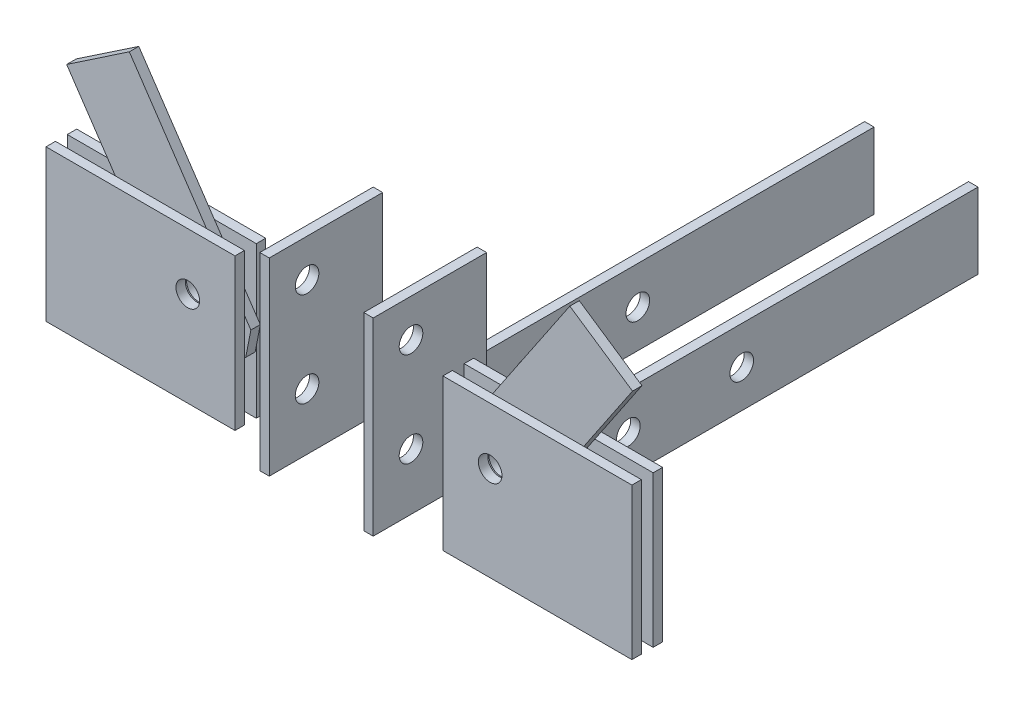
ISO-10303-21;
HEADER;
FILE_DESCRIPTION(('STEP AP214'),'2;1');
FILE_NAME('part.step','',(''),(''),'','','');
FILE_SCHEMA(('AUTOMOTIVE_DESIGN { 1 0 10303 214 1 1 1 1 }'));
ENDSEC;
DATA;
#1=APPLICATION_CONTEXT('core data for automotive mechanical design processes');
#2=APPLICATION_PROTOCOL_DEFINITION('international standard','automotive_design',2000,#1);
#3=PRODUCT_CONTEXT('',#1,'mechanical');
#4=PRODUCT('Part','Part','',(#3));
#5=PRODUCT_RELATED_PRODUCT_CATEGORY('part','',(#4));
#6=PRODUCT_DEFINITION_FORMATION('','',#4);
#7=PRODUCT_DEFINITION_CONTEXT('part definition',#1,'design');
#8=PRODUCT_DEFINITION('design','',#6,#7);
#9=PRODUCT_DEFINITION_SHAPE('','',#8);
#10=(LENGTH_UNIT() NAMED_UNIT(*) SI_UNIT(.MILLI.,.METRE.));
#11=(NAMED_UNIT(*) PLANE_ANGLE_UNIT() SI_UNIT($,.RADIAN.));
#12=(NAMED_UNIT(*) SI_UNIT($,.STERADIAN.) SOLID_ANGLE_UNIT());
#13=UNCERTAINTY_MEASURE_WITH_UNIT(LENGTH_MEASURE(1.E-05),#10,'distance_accuracy_value','');
#14=(GEOMETRIC_REPRESENTATION_CONTEXT(3) GLOBAL_UNCERTAINTY_ASSIGNED_CONTEXT((#13)) GLOBAL_UNIT_ASSIGNED_CONTEXT((#10,
#11,#12)) REPRESENTATION_CONTEXT('',''));
#15=CARTESIAN_POINT('',(0.,0.,0.));
#16=DIRECTION('',(0.,0.,1.));
#17=DIRECTION('',(1.,0.,0.));
#18=AXIS2_PLACEMENT_3D('',#15,#16,#17);
#19=CARTESIAN_POINT('',(19.05,12.7,-25.4));
#20=DIRECTION('',(1.,0.,0.));
#21=DIRECTION('',(0.,1.,0.));
#22=AXIS2_PLACEMENT_3D('',#19,#20,#21);
#23=PLANE('',#22);
#24=CARTESIAN_POINT('',(19.05,31.75,0.));
#25=DIRECTION('',(1.,0.,0.));
#26=DIRECTION('',(0.,0.,1.));
#27=AXIS2_PLACEMENT_3D('',#24,#25,#26);
#28=CIRCLE('',#27,3.96875);
#29=CARTESIAN_POINT('',(19.05,31.75,3.96875));
#30=VERTEX_POINT('',#29);
#31=EDGE_CURVE('P0_E11',#30,#30,#28,.T.);
#32=ORIENTED_EDGE('',*,*,#31,.F.);
#33=EDGE_LOOP('',(#32));
#34=FACE_BOUND('',#33,.T.);
#35=CARTESIAN_POINT('',(19.05,63.5,0.));
#36=DIRECTION('',(1.,0.,0.));
#37=DIRECTION('',(0.,0.,1.));
#38=AXIS2_PLACEMENT_3D('',#35,#36,#37);
#39=CIRCLE('',#38,3.96875);
#40=CARTESIAN_POINT('',(19.05,63.5,3.96875));
#41=VERTEX_POINT('',#40);
#42=EDGE_CURVE('P0_E113',#41,#41,#39,.T.);
#43=ORIENTED_EDGE('',*,*,#42,.F.);
#44=EDGE_LOOP('',(#43));
#45=FACE_BOUND('',#44,.T.);
#46=DIRECTION('',(0.,0.,1.));
#47=VECTOR('',#46,1.);
#48=CARTESIAN_POINT('',(19.05,12.7,-25.4));
#49=LINE('',#48,#47);
#50=CARTESIAN_POINT('',(19.05,12.7,-25.4));
#51=VERTEX_POINT('',#50);
#52=CARTESIAN_POINT('',(19.05,12.7,12.7));
#53=VERTEX_POINT('',#52);
#54=EDGE_CURVE('P0_E97',#51,#53,#49,.T.);
#55=ORIENTED_EDGE('',*,*,#54,.F.);
#56=DIRECTION('',(0.,1.,0.));
#57=VECTOR('',#56,1.);
#58=CARTESIAN_POINT('',(19.05,12.7,-25.4));
#59=LINE('',#58,#57);
#60=CARTESIAN_POINT('',(19.05,76.2,-25.4));
#61=VERTEX_POINT('',#60);
#62=EDGE_CURVE('P0_E96',#51,#61,#59,.T.);
#63=ORIENTED_EDGE('',*,*,#62,.T.);
#64=DIRECTION('',(0.,0.,1.));
#65=VECTOR('',#64,1.);
#66=CARTESIAN_POINT('',(19.05,76.2,-25.4));
#67=LINE('',#66,#65);
#68=CARTESIAN_POINT('',(19.05,76.2,12.7));
#69=VERTEX_POINT('',#68);
#70=EDGE_CURVE('P0_E85',#61,#69,#67,.T.);
#71=ORIENTED_EDGE('',*,*,#70,.T.);
#72=DIRECTION('',(0.,1.,0.));
#73=VECTOR('',#72,1.);
#74=CARTESIAN_POINT('',(19.05,12.7,12.7));
#75=LINE('',#74,#73);
#76=EDGE_CURVE('P0_E76',#53,#69,#75,.T.);
#77=ORIENTED_EDGE('',*,*,#76,.F.);
#78=EDGE_LOOP('',(#55,#63,#71,#77));
#79=FACE_BOUND('',#78,.T.);
#80=ADVANCED_FACE('P0_F17',(#34,#45,#79),#23,.T.);
#81=CARTESIAN_POINT('',(-21.59,31.75,0.));
#82=DIRECTION('',(1.,0.,0.));
#83=DIRECTION('',(0.,0.,1.));
#84=AXIS2_PLACEMENT_3D('',#81,#82,#83);
#85=CYLINDRICAL_SURFACE('',#84,3.96875);
#86=DIRECTION('',(1.,0.,0.));
#87=VECTOR('',#86,1.);
#88=CARTESIAN_POINT('',(-21.59,31.75,3.96875));
#89=LINE('',#88,#87);
#90=CARTESIAN_POINT('',(15.875,31.75,3.96875));
#91=VERTEX_POINT('',#90);
#92=EDGE_CURVE('P0_E27',#91,#30,#89,.T.);
#93=ORIENTED_EDGE('',*,*,#92,.F.);
#94=CARTESIAN_POINT('',(15.875,31.75,0.));
#95=DIRECTION('',(1.,0.,0.));
#96=DIRECTION('',(0.,0.,1.));
#97=AXIS2_PLACEMENT_3D('',#94,#95,#96);
#98=CIRCLE('',#97,3.96875);
#99=EDGE_CURVE('P0_E125',#91,#91,#98,.T.);
#100=ORIENTED_EDGE('',*,*,#99,.F.);
#101=ORIENTED_EDGE('',*,*,#92,.T.);
#102=ORIENTED_EDGE('',*,*,#31,.T.);
#103=EDGE_LOOP('',(#93,#100,#101,#102));
#104=FACE_BOUND('',#103,.T.);
#105=ADVANCED_FACE('P0_F120',(#104),#85,.F.);
#106=CARTESIAN_POINT('',(-21.59,63.5,0.));
#107=DIRECTION('',(1.,0.,0.));
#108=DIRECTION('',(0.,0.,1.));
#109=AXIS2_PLACEMENT_3D('',#106,#107,#108);
#110=CYLINDRICAL_SURFACE('',#109,3.96875);
#111=DIRECTION('',(1.,0.,0.));
#112=VECTOR('',#111,1.);
#113=CARTESIAN_POINT('',(-21.59,63.5,3.96875));
#114=LINE('',#113,#112);
#115=CARTESIAN_POINT('',(15.875,63.5,3.96875));
#116=VERTEX_POINT('',#115);
#117=EDGE_CURVE('P0_E92',#116,#41,#114,.T.);
#118=ORIENTED_EDGE('',*,*,#117,.F.);
#119=CARTESIAN_POINT('',(15.875,63.5,0.));
#120=DIRECTION('',(1.,0.,0.));
#121=DIRECTION('',(0.,0.,1.));
#122=AXIS2_PLACEMENT_3D('',#119,#120,#121);
#123=CIRCLE('',#122,3.96875);
#124=EDGE_CURVE('P0_E126',#116,#116,#123,.T.);
#125=ORIENTED_EDGE('',*,*,#124,.F.);
#126=ORIENTED_EDGE('',*,*,#117,.T.);
#127=ORIENTED_EDGE('',*,*,#42,.T.);
#128=EDGE_LOOP('',(#118,#125,#126,#127));
#129=FACE_BOUND('',#128,.T.);
#130=ADVANCED_FACE('P0_F190',(#129),#110,.F.);
#131=CARTESIAN_POINT('',(15.875,76.2,-25.4));
#132=DIRECTION('',(0.,1.,0.));
#133=DIRECTION('',(1.,0.,0.));
#134=AXIS2_PLACEMENT_3D('',#131,#132,#133);
#135=PLANE('',#134);
#136=DIRECTION('',(1.,0.,0.));
#137=VECTOR('',#136,1.);
#138=CARTESIAN_POINT('',(15.875,76.2,-25.4));
#139=LINE('',#138,#137);
#140=CARTESIAN_POINT('',(15.875,76.2,-25.4));
#141=VERTEX_POINT('',#140);
#142=EDGE_CURVE('P0_E93',#141,#61,#139,.T.);
#143=ORIENTED_EDGE('',*,*,#142,.F.);
#144=DIRECTION('',(0.,0.,1.));
#145=VECTOR('',#144,1.);
#146=CARTESIAN_POINT('',(15.875,76.2,-25.4));
#147=LINE('',#146,#145);
#148=CARTESIAN_POINT('',(15.875,76.2,12.7));
#149=VERTEX_POINT('',#148);
#150=EDGE_CURVE('P0_E153',#141,#149,#147,.T.);
#151=ORIENTED_EDGE('',*,*,#150,.T.);
#152=DIRECTION('',(1.,0.,0.));
#153=VECTOR('',#152,1.);
#154=CARTESIAN_POINT('',(15.875,76.2,12.7));
#155=LINE('',#154,#153);
#156=EDGE_CURVE('P0_E91',#149,#69,#155,.T.);
#157=ORIENTED_EDGE('',*,*,#156,.T.);
#158=ORIENTED_EDGE('',*,*,#70,.F.);
#159=EDGE_LOOP('',(#143,#151,#157,#158));
#160=FACE_BOUND('',#159,.T.);
#161=ADVANCED_FACE('P0_F86',(#160),#135,.T.);
#162=CARTESIAN_POINT('',(15.875,12.7,-25.4));
#163=DIRECTION('',(0.,0.,1.));
#164=DIRECTION('',(1.,0.,0.));
#165=AXIS2_PLACEMENT_3D('',#162,#163,#164);
#166=PLANE('',#165);
#167=ORIENTED_EDGE('',*,*,#142,.T.);
#168=ORIENTED_EDGE('',*,*,#62,.F.);
#169=DIRECTION('',(1.,0.,0.));
#170=VECTOR('',#169,1.);
#171=CARTESIAN_POINT('',(15.875,12.7,-25.4));
#172=LINE('',#171,#170);
#173=CARTESIAN_POINT('',(15.875,12.7,-25.4));
#174=VERTEX_POINT('',#173);
#175=EDGE_CURVE('P0_E138',#174,#51,#172,.T.);
#176=ORIENTED_EDGE('',*,*,#175,.F.);
#177=DIRECTION('',(0.,1.,0.));
#178=VECTOR('',#177,1.);
#179=CARTESIAN_POINT('',(15.875,12.7,-25.4));
#180=LINE('',#179,#178);
#181=EDGE_CURVE('P0_E106',#174,#141,#180,.T.);
#182=ORIENTED_EDGE('',*,*,#181,.T.);
#183=EDGE_LOOP('',(#167,#168,#176,#182));
#184=FACE_BOUND('',#183,.T.);
#185=ADVANCED_FACE('P0_F102',(#184),#166,.F.);
#186=CARTESIAN_POINT('',(15.875,12.7,12.7));
#187=DIRECTION('',(0.,0.,1.));
#188=DIRECTION('',(1.,0.,0.));
#189=AXIS2_PLACEMENT_3D('',#186,#187,#188);
#190=PLANE('',#189);
#191=DIRECTION('',(0.,1.,0.));
#192=VECTOR('',#191,1.);
#193=CARTESIAN_POINT('',(15.875,12.7,12.7));
#194=LINE('',#193,#192);
#195=CARTESIAN_POINT('',(15.875,12.7,12.7));
#196=VERTEX_POINT('',#195);
#197=EDGE_CURVE('P0_E156',#196,#149,#194,.T.);
#198=ORIENTED_EDGE('',*,*,#197,.F.);
#199=DIRECTION('',(1.,0.,0.));
#200=VECTOR('',#199,1.);
#201=CARTESIAN_POINT('',(15.875,12.7,12.7));
#202=LINE('',#201,#200);
#203=EDGE_CURVE('P0_E132',#196,#53,#202,.T.);
#204=ORIENTED_EDGE('',*,*,#203,.T.);
#205=ORIENTED_EDGE('',*,*,#76,.T.);
#206=ORIENTED_EDGE('',*,*,#156,.F.);
#207=EDGE_LOOP('',(#198,#204,#205,#206));
#208=FACE_BOUND('',#207,.T.);
#209=ADVANCED_FACE('P0_F167',(#208),#190,.T.);
#210=CARTESIAN_POINT('',(15.875,12.7,-25.4));
#211=DIRECTION('',(0.,1.,0.));
#212=DIRECTION('',(1.,0.,0.));
#213=AXIS2_PLACEMENT_3D('',#210,#211,#212);
#214=PLANE('',#213);
#215=ORIENTED_EDGE('',*,*,#54,.T.);
#216=ORIENTED_EDGE('',*,*,#203,.F.);
#217=DIRECTION('',(0.,0.,1.));
#218=VECTOR('',#217,1.);
#219=CARTESIAN_POINT('',(15.875,12.7,-25.4));
#220=LINE('',#219,#218);
#221=EDGE_CURVE('P0_E137',#174,#196,#220,.T.);
#222=ORIENTED_EDGE('',*,*,#221,.F.);
#223=ORIENTED_EDGE('',*,*,#175,.T.);
#224=EDGE_LOOP('',(#215,#216,#222,#223));
#225=FACE_BOUND('',#224,.T.);
#226=ADVANCED_FACE('P0_F172',(#225),#214,.F.);
#227=CARTESIAN_POINT('',(15.875,12.7,-25.4));
#228=DIRECTION('',(1.,0.,0.));
#229=DIRECTION('',(0.,1.,0.));
#230=AXIS2_PLACEMENT_3D('',#227,#228,#229);
#231=PLANE('',#230);
#232=ORIENTED_EDGE('',*,*,#99,.T.);
#233=EDGE_LOOP('',(#232));
#234=FACE_BOUND('',#233,.T.);
#235=ORIENTED_EDGE('',*,*,#124,.T.);
#236=EDGE_LOOP('',(#235));
#237=FACE_BOUND('',#236,.T.);
#238=ORIENTED_EDGE('',*,*,#197,.T.);
#239=ORIENTED_EDGE('',*,*,#150,.F.);
#240=ORIENTED_EDGE('',*,*,#181,.F.);
#241=ORIENTED_EDGE('',*,*,#221,.T.);
#242=EDGE_LOOP('',(#238,#239,#240,#241));
#243=FACE_BOUND('',#242,.T.);
#244=ADVANCED_FACE('P0_F122',(#234,#237,#243),#231,.F.);
#245=CLOSED_SHELL('',(#80,#105,#130,#161,#185,#209,#226,#244));
#246=MANIFOLD_SOLID_BREP('P0_B1',#245);
#247=CARTESIAN_POINT('',(-15.875,12.7,-25.4));
#248=DIRECTION('',(1.,0.,0.));
#249=DIRECTION('',(0.,1.,0.));
#250=AXIS2_PLACEMENT_3D('',#247,#248,#249);
#251=PLANE('',#250);
#252=CARTESIAN_POINT('',(-15.875,31.75,0.));
#253=DIRECTION('',(1.,0.,0.));
#254=DIRECTION('',(0.,0.,1.));
#255=AXIS2_PLACEMENT_3D('',#252,#253,#254);
#256=CIRCLE('',#255,3.96875);
#257=CARTESIAN_POINT('',(-15.875,31.75,3.96875));
#258=VERTEX_POINT('',#257);
#259=EDGE_CURVE('P1_E11',#258,#258,#256,.T.);
#260=ORIENTED_EDGE('',*,*,#259,.F.);
#261=EDGE_LOOP('',(#260));
#262=FACE_BOUND('',#261,.T.);
#263=CARTESIAN_POINT('',(-15.875,63.5,0.));
#264=DIRECTION('',(1.,0.,0.));
#265=DIRECTION('',(0.,0.,1.));
#266=AXIS2_PLACEMENT_3D('',#263,#264,#265);
#267=CIRCLE('',#266,3.96875);
#268=CARTESIAN_POINT('',(-15.875,63.5,3.96875));
#269=VERTEX_POINT('',#268);
#270=EDGE_CURVE('P1_E47',#269,#269,#267,.T.);
#271=ORIENTED_EDGE('',*,*,#270,.F.);
#272=EDGE_LOOP('',(#271));
#273=FACE_BOUND('',#272,.T.);
#274=DIRECTION('',(0.,0.,1.));
#275=VECTOR('',#274,1.);
#276=CARTESIAN_POINT('',(-15.875,12.7,-25.4));
#277=LINE('',#276,#275);
#278=CARTESIAN_POINT('',(-15.875,12.7,-25.4));
#279=VERTEX_POINT('',#278);
#280=CARTESIAN_POINT('',(-15.875,12.7,12.7));
#281=VERTEX_POINT('',#280);
#282=EDGE_CURVE('P1_E106',#279,#281,#277,.T.);
#283=ORIENTED_EDGE('',*,*,#282,.F.);
#284=DIRECTION('',(0.,1.,0.));
#285=VECTOR('',#284,1.);
#286=CARTESIAN_POINT('',(-15.875,12.7,-25.4));
#287=LINE('',#286,#285);
#288=CARTESIAN_POINT('',(-15.875,76.2,-25.4));
#289=VERTEX_POINT('',#288);
#290=EDGE_CURVE('P1_E145',#279,#289,#287,.T.);
#291=ORIENTED_EDGE('',*,*,#290,.T.);
#292=DIRECTION('',(0.,0.,1.));
#293=VECTOR('',#292,1.);
#294=CARTESIAN_POINT('',(-15.875,76.2,-25.4));
#295=LINE('',#294,#293);
#296=CARTESIAN_POINT('',(-15.875,76.2,12.7));
#297=VERTEX_POINT('',#296);
#298=EDGE_CURVE('P1_E67',#289,#297,#295,.T.);
#299=ORIENTED_EDGE('',*,*,#298,.T.);
#300=DIRECTION('',(0.,1.,0.));
#301=VECTOR('',#300,1.);
#302=CARTESIAN_POINT('',(-15.875,12.7,12.7));
#303=LINE('',#302,#301);
#304=EDGE_CURVE('P1_E74',#281,#297,#303,.T.);
#305=ORIENTED_EDGE('',*,*,#304,.F.);
#306=EDGE_LOOP('',(#283,#291,#299,#305));
#307=FACE_BOUND('',#306,.T.);
#308=ADVANCED_FACE('P1_F17',(#262,#273,#307),#251,.T.);
#309=CARTESIAN_POINT('',(-21.59,31.75,0.));
#310=DIRECTION('',(1.,0.,0.));
#311=DIRECTION('',(0.,0.,1.));
#312=AXIS2_PLACEMENT_3D('',#309,#310,#311);
#313=CYLINDRICAL_SURFACE('',#312,3.96875);
#314=DIRECTION('',(1.,0.,0.));
#315=VECTOR('',#314,1.);
#316=CARTESIAN_POINT('',(-21.59,31.75,3.96875));
#317=LINE('',#316,#315);
#318=CARTESIAN_POINT('',(-19.05,31.75,3.96875));
#319=VERTEX_POINT('',#318);
#320=EDGE_CURVE('P1_E21',#319,#258,#317,.T.);
#321=ORIENTED_EDGE('',*,*,#320,.F.);
#322=CARTESIAN_POINT('',(-19.05,31.75,0.));
#323=DIRECTION('',(1.,0.,0.));
#324=DIRECTION('',(0.,0.,1.));
#325=AXIS2_PLACEMENT_3D('',#322,#323,#324);
#326=CIRCLE('',#325,3.96875);
#327=EDGE_CURVE('P1_E99',#319,#319,#326,.T.);
#328=ORIENTED_EDGE('',*,*,#327,.F.);
#329=ORIENTED_EDGE('',*,*,#320,.T.);
#330=ORIENTED_EDGE('',*,*,#259,.T.);
#331=EDGE_LOOP('',(#321,#328,#329,#330));
#332=FACE_BOUND('',#331,.T.);
#333=ADVANCED_FACE('P1_F97',(#332),#313,.F.);
#334=CARTESIAN_POINT('',(-21.59,63.5,0.));
#335=DIRECTION('',(1.,0.,0.));
#336=DIRECTION('',(0.,0.,1.));
#337=AXIS2_PLACEMENT_3D('',#334,#335,#336);
#338=CYLINDRICAL_SURFACE('',#337,3.96875);
#339=DIRECTION('',(1.,0.,0.));
#340=VECTOR('',#339,1.);
#341=CARTESIAN_POINT('',(-21.59,63.5,3.96875));
#342=LINE('',#341,#340);
#343=CARTESIAN_POINT('',(-19.05,63.5,3.96875));
#344=VERTEX_POINT('',#343);
#345=EDGE_CURVE('P1_E94',#344,#269,#342,.T.);
#346=ORIENTED_EDGE('',*,*,#345,.F.);
#347=CARTESIAN_POINT('',(-19.05,63.5,0.));
#348=DIRECTION('',(1.,0.,0.));
#349=DIRECTION('',(0.,0.,1.));
#350=AXIS2_PLACEMENT_3D('',#347,#348,#349);
#351=CIRCLE('',#350,3.96875);
#352=EDGE_CURVE('P1_E110',#344,#344,#351,.T.);
#353=ORIENTED_EDGE('',*,*,#352,.F.);
#354=ORIENTED_EDGE('',*,*,#345,.T.);
#355=ORIENTED_EDGE('',*,*,#270,.T.);
#356=EDGE_LOOP('',(#346,#353,#354,#355));
#357=FACE_BOUND('',#356,.T.);
#358=ADVANCED_FACE('P1_F19',(#357),#338,.F.);
#359=CARTESIAN_POINT('',(-19.05,76.2,-25.4));
#360=DIRECTION('',(0.,1.,0.));
#361=DIRECTION('',(1.,0.,0.));
#362=AXIS2_PLACEMENT_3D('',#359,#360,#361);
#363=PLANE('',#362);
#364=DIRECTION('',(1.,0.,0.));
#365=VECTOR('',#364,1.);
#366=CARTESIAN_POINT('',(-19.05,76.2,-25.4));
#367=LINE('',#366,#365);
#368=CARTESIAN_POINT('',(-19.05,76.2,-25.4));
#369=VERTEX_POINT('',#368);
#370=EDGE_CURVE('P1_E134',#369,#289,#367,.T.);
#371=ORIENTED_EDGE('',*,*,#370,.F.);
#372=DIRECTION('',(0.,0.,1.));
#373=VECTOR('',#372,1.);
#374=CARTESIAN_POINT('',(-19.05,76.2,-25.4));
#375=LINE('',#374,#373);
#376=CARTESIAN_POINT('',(-19.05,76.2,12.7));
#377=VERTEX_POINT('',#376);
#378=EDGE_CURVE('P1_E124',#369,#377,#375,.T.);
#379=ORIENTED_EDGE('',*,*,#378,.T.);
#380=DIRECTION('',(1.,0.,0.));
#381=VECTOR('',#380,1.);
#382=CARTESIAN_POINT('',(-19.05,76.2,12.7));
#383=LINE('',#382,#381);
#384=EDGE_CURVE('P1_E132',#377,#297,#383,.T.);
#385=ORIENTED_EDGE('',*,*,#384,.T.);
#386=ORIENTED_EDGE('',*,*,#298,.F.);
#387=EDGE_LOOP('',(#371,#379,#385,#386));
#388=FACE_BOUND('',#387,.T.);
#389=ADVANCED_FACE('P1_F169',(#388),#363,.T.);
#390=CARTESIAN_POINT('',(-19.05,12.7,-25.4));
#391=DIRECTION('',(0.,0.,1.));
#392=DIRECTION('',(1.,0.,0.));
#393=AXIS2_PLACEMENT_3D('',#390,#391,#392);
#394=PLANE('',#393);
#395=ORIENTED_EDGE('',*,*,#370,.T.);
#396=ORIENTED_EDGE('',*,*,#290,.F.);
#397=DIRECTION('',(1.,0.,0.));
#398=VECTOR('',#397,1.);
#399=CARTESIAN_POINT('',(-19.05,12.7,-25.4));
#400=LINE('',#399,#398);
#401=CARTESIAN_POINT('',(-19.05,12.7,-25.4));
#402=VERTEX_POINT('',#401);
#403=EDGE_CURVE('P1_E127',#402,#279,#400,.T.);
#404=ORIENTED_EDGE('',*,*,#403,.F.);
#405=DIRECTION('',(0.,1.,0.));
#406=VECTOR('',#405,1.);
#407=CARTESIAN_POINT('',(-19.05,12.7,-25.4));
#408=LINE('',#407,#406);
#409=EDGE_CURVE('P1_E120',#402,#369,#408,.T.);
#410=ORIENTED_EDGE('',*,*,#409,.T.);
#411=EDGE_LOOP('',(#395,#396,#404,#410));
#412=FACE_BOUND('',#411,.T.);
#413=ADVANCED_FACE('P1_F168',(#412),#394,.F.);
#414=CARTESIAN_POINT('',(-19.05,12.7,12.7));
#415=DIRECTION('',(0.,0.,1.));
#416=DIRECTION('',(1.,0.,0.));
#417=AXIS2_PLACEMENT_3D('',#414,#415,#416);
#418=PLANE('',#417);
#419=DIRECTION('',(0.,1.,0.));
#420=VECTOR('',#419,1.);
#421=CARTESIAN_POINT('',(-19.05,12.7,12.7));
#422=LINE('',#421,#420);
#423=CARTESIAN_POINT('',(-19.05,12.7,12.7));
#424=VERTEX_POINT('',#423);
#425=EDGE_CURVE('P1_E160',#424,#377,#422,.T.);
#426=ORIENTED_EDGE('',*,*,#425,.F.);
#427=DIRECTION('',(1.,0.,0.));
#428=VECTOR('',#427,1.);
#429=CARTESIAN_POINT('',(-19.05,12.7,12.7));
#430=LINE('',#429,#428);
#431=EDGE_CURVE('P1_E114',#424,#281,#430,.T.);
#432=ORIENTED_EDGE('',*,*,#431,.T.);
#433=ORIENTED_EDGE('',*,*,#304,.T.);
#434=ORIENTED_EDGE('',*,*,#384,.F.);
#435=EDGE_LOOP('',(#426,#432,#433,#434));
#436=FACE_BOUND('',#435,.T.);
#437=ADVANCED_FACE('P1_F174',(#436),#418,.T.);
#438=CARTESIAN_POINT('',(-19.05,12.7,-25.4));
#439=DIRECTION('',(0.,1.,0.));
#440=DIRECTION('',(1.,0.,0.));
#441=AXIS2_PLACEMENT_3D('',#438,#439,#440);
#442=PLANE('',#441);
#443=ORIENTED_EDGE('',*,*,#282,.T.);
#444=ORIENTED_EDGE('',*,*,#431,.F.);
#445=DIRECTION('',(0.,0.,1.));
#446=VECTOR('',#445,1.);
#447=CARTESIAN_POINT('',(-19.05,12.7,-25.4));
#448=LINE('',#447,#446);
#449=EDGE_CURVE('P1_E116',#402,#424,#448,.T.);
#450=ORIENTED_EDGE('',*,*,#449,.F.);
#451=ORIENTED_EDGE('',*,*,#403,.T.);
#452=EDGE_LOOP('',(#443,#444,#450,#451));
#453=FACE_BOUND('',#452,.T.);
#454=ADVANCED_FACE('P1_F155',(#453),#442,.F.);
#455=CARTESIAN_POINT('',(-19.05,12.7,-25.4));
#456=DIRECTION('',(1.,0.,0.));
#457=DIRECTION('',(0.,1.,0.));
#458=AXIS2_PLACEMENT_3D('',#455,#456,#457);
#459=PLANE('',#458);
#460=ORIENTED_EDGE('',*,*,#327,.T.);
#461=EDGE_LOOP('',(#460));
#462=FACE_BOUND('',#461,.T.);
#463=ORIENTED_EDGE('',*,*,#352,.T.);
#464=EDGE_LOOP('',(#463));
#465=FACE_BOUND('',#464,.T.);
#466=ORIENTED_EDGE('',*,*,#425,.T.);
#467=ORIENTED_EDGE('',*,*,#378,.F.);
#468=ORIENTED_EDGE('',*,*,#409,.F.);
#469=ORIENTED_EDGE('',*,*,#449,.T.);
#470=EDGE_LOOP('',(#466,#467,#468,#469));
#471=FACE_BOUND('',#470,.T.);
#472=ADVANCED_FACE('P1_F103',(#462,#465,#471),#459,.F.);
#473=CLOSED_SHELL('',(#308,#333,#358,#389,#413,#437,#454,#472));
#474=MANIFOLD_SOLID_BREP('P1_B1',#473);
#475=CARTESIAN_POINT('',(19.05,-12.7,-190.5));
#476=DIRECTION('',(1.,0.,0.));
#477=DIRECTION('',(0.,1.,0.));
#478=AXIS2_PLACEMENT_3D('',#475,#476,#477);
#479=PLANE('',#478);
#480=CARTESIAN_POINT('',(19.05,0.,-73.025));
#481=DIRECTION('',(1.,0.,0.));
#482=DIRECTION('',(0.,0.,1.));
#483=AXIS2_PLACEMENT_3D('',#480,#481,#482);
#484=CIRCLE('',#483,3.96875);
#485=CARTESIAN_POINT('',(19.05,0.,-69.05625));
#486=VERTEX_POINT('',#485);
#487=EDGE_CURVE('P2_E11',#486,#486,#484,.T.);
#488=ORIENTED_EDGE('',*,*,#487,.F.);
#489=EDGE_LOOP('',(#488));
#490=FACE_BOUND('',#489,.T.);
#491=CARTESIAN_POINT('',(19.05,0.,-111.125));
#492=DIRECTION('',(1.,0.,0.));
#493=DIRECTION('',(0.,0.,1.));
#494=AXIS2_PLACEMENT_3D('',#491,#492,#493);
#495=CIRCLE('',#494,3.96875);
#496=CARTESIAN_POINT('',(19.05,0.,-107.15625));
#497=VERTEX_POINT('',#496);
#498=EDGE_CURVE('P2_E92',#497,#497,#495,.T.);
#499=ORIENTED_EDGE('',*,*,#498,.F.);
#500=EDGE_LOOP('',(#499));
#501=FACE_BOUND('',#500,.T.);
#502=DIRECTION('',(0.,0.,1.));
#503=VECTOR('',#502,1.);
#504=CARTESIAN_POINT('',(19.05,-12.7,-190.5));
#505=LINE('',#504,#503);
#506=CARTESIAN_POINT('',(19.05,-12.7,-190.5));
#507=VERTEX_POINT('',#506);
#508=CARTESIAN_POINT('',(19.05,-12.7,-60.325));
#509=VERTEX_POINT('',#508);
#510=EDGE_CURVE('P2_E99',#507,#509,#505,.T.);
#511=ORIENTED_EDGE('',*,*,#510,.F.);
#512=DIRECTION('',(0.,1.,0.));
#513=VECTOR('',#512,1.);
#514=CARTESIAN_POINT('',(19.05,-12.7,-190.5));
#515=LINE('',#514,#513);
#516=CARTESIAN_POINT('',(19.05,12.7,-190.5));
#517=VERTEX_POINT('',#516);
#518=EDGE_CURVE('P2_E140',#507,#517,#515,.T.);
#519=ORIENTED_EDGE('',*,*,#518,.T.);
#520=DIRECTION('',(0.,0.,1.));
#521=VECTOR('',#520,1.);
#522=CARTESIAN_POINT('',(19.05,12.7,-190.5));
#523=LINE('',#522,#521);
#524=CARTESIAN_POINT('',(19.05,12.7,-60.325));
#525=VERTEX_POINT('',#524);
#526=EDGE_CURVE('P2_E49',#517,#525,#523,.T.);
#527=ORIENTED_EDGE('',*,*,#526,.T.);
#528=DIRECTION('',(0.,1.,0.));
#529=VECTOR('',#528,1.);
#530=CARTESIAN_POINT('',(19.05,-12.7,-60.325));
#531=LINE('',#530,#529);
#532=EDGE_CURVE('P2_E65',#509,#525,#531,.T.);
#533=ORIENTED_EDGE('',*,*,#532,.F.);
#534=EDGE_LOOP('',(#511,#519,#527,#533));
#535=FACE_BOUND('',#534,.T.);
#536=ADVANCED_FACE('P2_F17',(#490,#501,#535),#479,.T.);
#537=CARTESIAN_POINT('',(-21.59,0.,-73.025));
#538=DIRECTION('',(1.,0.,0.));
#539=DIRECTION('',(0.,0.,1.));
#540=AXIS2_PLACEMENT_3D('',#537,#538,#539);
#541=CYLINDRICAL_SURFACE('',#540,3.96875);
#542=DIRECTION('',(1.,0.,0.));
#543=VECTOR('',#542,1.);
#544=CARTESIAN_POINT('',(-21.59,0.,-69.05625));
#545=LINE('',#544,#543);
#546=CARTESIAN_POINT('',(15.875,0.,-69.05625));
#547=VERTEX_POINT('',#546);
#548=EDGE_CURVE('P2_E20',#547,#486,#545,.T.);
#549=ORIENTED_EDGE('',*,*,#548,.F.);
#550=CARTESIAN_POINT('',(15.875,0.,-73.025));
#551=DIRECTION('',(1.,0.,0.));
#552=DIRECTION('',(0.,0.,1.));
#553=AXIS2_PLACEMENT_3D('',#550,#551,#552);
#554=CIRCLE('',#553,3.96875);
#555=EDGE_CURVE('P2_E91',#547,#547,#554,.T.);
#556=ORIENTED_EDGE('',*,*,#555,.F.);
#557=ORIENTED_EDGE('',*,*,#548,.T.);
#558=ORIENTED_EDGE('',*,*,#487,.T.);
#559=EDGE_LOOP('',(#549,#556,#557,#558));
#560=FACE_BOUND('',#559,.T.);
#561=ADVANCED_FACE('P2_F95',(#560),#541,.F.);
#562=CARTESIAN_POINT('',(-21.59,0.,-111.125));
#563=DIRECTION('',(1.,0.,0.));
#564=DIRECTION('',(0.,0.,1.));
#565=AXIS2_PLACEMENT_3D('',#562,#563,#564);
#566=CYLINDRICAL_SURFACE('',#565,3.96875);
#567=DIRECTION('',(1.,0.,0.));
#568=VECTOR('',#567,1.);
#569=CARTESIAN_POINT('',(-21.59,0.,-107.15625));
#570=LINE('',#569,#568);
#571=CARTESIAN_POINT('',(15.875,0.,-107.15625));
#572=VERTEX_POINT('',#571);
#573=EDGE_CURVE('P2_E136',#572,#497,#570,.T.);
#574=ORIENTED_EDGE('',*,*,#573,.F.);
#575=CARTESIAN_POINT('',(15.875,0.,-111.125));
#576=DIRECTION('',(1.,0.,0.));
#577=DIRECTION('',(0.,0.,1.));
#578=AXIS2_PLACEMENT_3D('',#575,#576,#577);
#579=CIRCLE('',#578,3.96875);
#580=EDGE_CURVE('P2_E101',#572,#572,#579,.T.);
#581=ORIENTED_EDGE('',*,*,#580,.F.);
#582=ORIENTED_EDGE('',*,*,#573,.T.);
#583=ORIENTED_EDGE('',*,*,#498,.T.);
#584=EDGE_LOOP('',(#574,#581,#582,#583));
#585=FACE_BOUND('',#584,.T.);
#586=ADVANCED_FACE('P2_F160',(#585),#566,.F.);
#587=CARTESIAN_POINT('',(15.875,12.7,-190.5));
#588=DIRECTION('',(0.,1.,0.));
#589=DIRECTION('',(1.,0.,0.));
#590=AXIS2_PLACEMENT_3D('',#587,#588,#589);
#591=PLANE('',#590);
#592=DIRECTION('',(1.,0.,0.));
#593=VECTOR('',#592,1.);
#594=CARTESIAN_POINT('',(15.875,12.7,-190.5));
#595=LINE('',#594,#593);
#596=CARTESIAN_POINT('',(15.875,12.7,-190.5));
#597=VERTEX_POINT('',#596);
#598=EDGE_CURVE('P2_E138',#597,#517,#595,.T.);
#599=ORIENTED_EDGE('',*,*,#598,.F.);
#600=DIRECTION('',(0.,0.,1.));
#601=VECTOR('',#600,1.);
#602=CARTESIAN_POINT('',(15.875,12.7,-190.5));
#603=LINE('',#602,#601);
#604=CARTESIAN_POINT('',(15.875,12.7,-60.325));
#605=VERTEX_POINT('',#604);
#606=EDGE_CURVE('P2_E118',#597,#605,#603,.T.);
#607=ORIENTED_EDGE('',*,*,#606,.T.);
#608=DIRECTION('',(1.,0.,0.));
#609=VECTOR('',#608,1.);
#610=CARTESIAN_POINT('',(15.875,12.7,-60.325));
#611=LINE('',#610,#609);
#612=EDGE_CURVE('P2_E143',#605,#525,#611,.T.);
#613=ORIENTED_EDGE('',*,*,#612,.T.);
#614=ORIENTED_EDGE('',*,*,#526,.F.);
#615=EDGE_LOOP('',(#599,#607,#613,#614));
#616=FACE_BOUND('',#615,.T.);
#617=ADVANCED_FACE('P2_F169',(#616),#591,.T.);
#618=CARTESIAN_POINT('',(15.875,-12.7,-190.5));
#619=DIRECTION('',(0.,0.,1.));
#620=DIRECTION('',(1.,0.,0.));
#621=AXIS2_PLACEMENT_3D('',#618,#619,#620);
#622=PLANE('',#621);
#623=ORIENTED_EDGE('',*,*,#598,.T.);
#624=ORIENTED_EDGE('',*,*,#518,.F.);
#625=DIRECTION('',(1.,0.,0.));
#626=VECTOR('',#625,1.);
#627=CARTESIAN_POINT('',(15.875,-12.7,-190.5));
#628=LINE('',#627,#626);
#629=CARTESIAN_POINT('',(15.875,-12.7,-190.5));
#630=VERTEX_POINT('',#629);
#631=EDGE_CURVE('P2_E122',#630,#507,#628,.T.);
#632=ORIENTED_EDGE('',*,*,#631,.F.);
#633=DIRECTION('',(0.,1.,0.));
#634=VECTOR('',#633,1.);
#635=CARTESIAN_POINT('',(15.875,-12.7,-190.5));
#636=LINE('',#635,#634);
#637=EDGE_CURVE('P2_E123',#630,#597,#636,.T.);
#638=ORIENTED_EDGE('',*,*,#637,.T.);
#639=EDGE_LOOP('',(#623,#624,#632,#638));
#640=FACE_BOUND('',#639,.T.);
#641=ADVANCED_FACE('P2_F167',(#640),#622,.F.);
#642=CARTESIAN_POINT('',(15.875,-12.7,-60.325));
#643=DIRECTION('',(0.,0.,1.));
#644=DIRECTION('',(1.,0.,0.));
#645=AXIS2_PLACEMENT_3D('',#642,#643,#644);
#646=PLANE('',#645);
#647=DIRECTION('',(0.,1.,0.));
#648=VECTOR('',#647,1.);
#649=CARTESIAN_POINT('',(15.875,-12.7,-60.325));
#650=LINE('',#649,#648);
#651=CARTESIAN_POINT('',(15.875,-12.7,-60.325));
#652=VERTEX_POINT('',#651);
#653=EDGE_CURVE('P2_E116',#652,#605,#650,.T.);
#654=ORIENTED_EDGE('',*,*,#653,.F.);
#655=DIRECTION('',(1.,0.,0.));
#656=VECTOR('',#655,1.);
#657=CARTESIAN_POINT('',(15.875,-12.7,-60.325));
#658=LINE('',#657,#656);
#659=EDGE_CURVE('P2_E107',#652,#509,#658,.T.);
#660=ORIENTED_EDGE('',*,*,#659,.T.);
#661=ORIENTED_EDGE('',*,*,#532,.T.);
#662=ORIENTED_EDGE('',*,*,#612,.F.);
#663=EDGE_LOOP('',(#654,#660,#661,#662));
#664=FACE_BOUND('',#663,.T.);
#665=ADVANCED_FACE('P2_F172',(#664),#646,.T.);
#666=CARTESIAN_POINT('',(15.875,-12.7,-190.5));
#667=DIRECTION('',(0.,1.,0.));
#668=DIRECTION('',(1.,0.,0.));
#669=AXIS2_PLACEMENT_3D('',#666,#667,#668);
#670=PLANE('',#669);
#671=ORIENTED_EDGE('',*,*,#510,.T.);
#672=ORIENTED_EDGE('',*,*,#659,.F.);
#673=DIRECTION('',(0.,0.,1.));
#674=VECTOR('',#673,1.);
#675=CARTESIAN_POINT('',(15.875,-12.7,-190.5));
#676=LINE('',#675,#674);
#677=EDGE_CURVE('P2_E115',#630,#652,#676,.T.);
#678=ORIENTED_EDGE('',*,*,#677,.F.);
#679=ORIENTED_EDGE('',*,*,#631,.T.);
#680=EDGE_LOOP('',(#671,#672,#678,#679));
#681=FACE_BOUND('',#680,.T.);
#682=ADVANCED_FACE('P2_F165',(#681),#670,.F.);
#683=CARTESIAN_POINT('',(15.875,-12.7,-190.5));
#684=DIRECTION('',(1.,0.,0.));
#685=DIRECTION('',(0.,1.,0.));
#686=AXIS2_PLACEMENT_3D('',#683,#684,#685);
#687=PLANE('',#686);
#688=ORIENTED_EDGE('',*,*,#555,.T.);
#689=EDGE_LOOP('',(#688));
#690=FACE_BOUND('',#689,.T.);
#691=ORIENTED_EDGE('',*,*,#580,.T.);
#692=EDGE_LOOP('',(#691));
#693=FACE_BOUND('',#692,.T.);
#694=ORIENTED_EDGE('',*,*,#653,.T.);
#695=ORIENTED_EDGE('',*,*,#606,.F.);
#696=ORIENTED_EDGE('',*,*,#637,.F.);
#697=ORIENTED_EDGE('',*,*,#677,.T.);
#698=EDGE_LOOP('',(#694,#695,#696,#697));
#699=FACE_BOUND('',#698,.T.);
#700=ADVANCED_FACE('P2_F100',(#690,#693,#699),#687,.F.);
#701=CLOSED_SHELL('',(#536,#561,#586,#617,#641,#665,#682,#700));
#702=MANIFOLD_SOLID_BREP('P2_B1',#701);
#703=CARTESIAN_POINT('',(-15.875,-12.7,-190.5));
#704=DIRECTION('',(1.,0.,0.));
#705=DIRECTION('',(0.,1.,0.));
#706=AXIS2_PLACEMENT_3D('',#703,#704,#705);
#707=PLANE('',#706);
#708=CARTESIAN_POINT('',(-15.875,0.,-73.025));
#709=DIRECTION('',(1.,0.,0.));
#710=DIRECTION('',(0.,0.,1.));
#711=AXIS2_PLACEMENT_3D('',#708,#709,#710);
#712=CIRCLE('',#711,3.96875);
#713=CARTESIAN_POINT('',(-15.875,0.,-69.05625));
#714=VERTEX_POINT('',#713);
#715=EDGE_CURVE('P3_E11',#714,#714,#712,.T.);
#716=ORIENTED_EDGE('',*,*,#715,.F.);
#717=EDGE_LOOP('',(#716));
#718=FACE_BOUND('',#717,.T.);
#719=CARTESIAN_POINT('',(-15.875,0.,-111.125));
#720=DIRECTION('',(1.,0.,0.));
#721=DIRECTION('',(0.,0.,1.));
#722=AXIS2_PLACEMENT_3D('',#719,#720,#721);
#723=CIRCLE('',#722,3.96875);
#724=CARTESIAN_POINT('',(-15.875,0.,-107.15625));
#725=VERTEX_POINT('',#724);
#726=EDGE_CURVE('P3_E44',#725,#725,#723,.T.);
#727=ORIENTED_EDGE('',*,*,#726,.F.);
#728=EDGE_LOOP('',(#727));
#729=FACE_BOUND('',#728,.T.);
#730=DIRECTION('',(0.,0.,1.));
#731=VECTOR('',#730,1.);
#732=CARTESIAN_POINT('',(-15.875,-12.7,-190.5));
#733=LINE('',#732,#731);
#734=CARTESIAN_POINT('',(-15.875,-12.7,-190.5));
#735=VERTEX_POINT('',#734);
#736=CARTESIAN_POINT('',(-15.875,-12.7,-60.325));
#737=VERTEX_POINT('',#736);
#738=EDGE_CURVE('P3_E135',#735,#737,#733,.T.);
#739=ORIENTED_EDGE('',*,*,#738,.F.);
#740=DIRECTION('',(0.,1.,0.));
#741=VECTOR('',#740,1.);
#742=CARTESIAN_POINT('',(-15.875,-12.7,-190.5));
#743=LINE('',#742,#741);
#744=CARTESIAN_POINT('',(-15.875,12.7,-190.5));
#745=VERTEX_POINT('',#744);
#746=EDGE_CURVE('P3_E92',#735,#745,#743,.T.);
#747=ORIENTED_EDGE('',*,*,#746,.T.);
#748=DIRECTION('',(0.,0.,1.));
#749=VECTOR('',#748,1.);
#750=CARTESIAN_POINT('',(-15.875,12.7,-190.5));
#751=LINE('',#750,#749);
#752=CARTESIAN_POINT('',(-15.875,12.7,-60.325));
#753=VERTEX_POINT('',#752);
#754=EDGE_CURVE('P3_E142',#745,#753,#751,.T.);
#755=ORIENTED_EDGE('',*,*,#754,.T.);
#756=DIRECTION('',(0.,1.,0.));
#757=VECTOR('',#756,1.);
#758=CARTESIAN_POINT('',(-15.875,-12.7,-60.325));
#759=LINE('',#758,#757);
#760=EDGE_CURVE('P3_E99',#737,#753,#759,.T.);
#761=ORIENTED_EDGE('',*,*,#760,.F.);
#762=EDGE_LOOP('',(#739,#747,#755,#761));
#763=FACE_BOUND('',#762,.T.);
#764=ADVANCED_FACE('P3_F17',(#718,#729,#763),#707,.T.);
#765=CARTESIAN_POINT('',(-21.59,0.,-73.025));
#766=DIRECTION('',(1.,0.,0.));
#767=DIRECTION('',(0.,0.,1.));
#768=AXIS2_PLACEMENT_3D('',#765,#766,#767);
#769=CYLINDRICAL_SURFACE('',#768,3.96875);
#770=DIRECTION('',(1.,0.,0.));
#771=VECTOR('',#770,1.);
#772=CARTESIAN_POINT('',(-21.59,0.,-69.05625));
#773=LINE('',#772,#771);
#774=CARTESIAN_POINT('',(-19.05,0.,-69.05625));
#775=VERTEX_POINT('',#774);
#776=EDGE_CURVE('P3_E27',#775,#714,#773,.T.);
#777=ORIENTED_EDGE('',*,*,#776,.F.);
#778=CARTESIAN_POINT('',(-19.05,0.,-73.025));
#779=DIRECTION('',(1.,0.,0.));
#780=DIRECTION('',(0.,0.,1.));
#781=AXIS2_PLACEMENT_3D('',#778,#779,#780);
#782=CIRCLE('',#781,3.96875);
#783=EDGE_CURVE('P3_E126',#775,#775,#782,.T.);
#784=ORIENTED_EDGE('',*,*,#783,.F.);
#785=ORIENTED_EDGE('',*,*,#776,.T.);
#786=ORIENTED_EDGE('',*,*,#715,.T.);
#787=EDGE_LOOP('',(#777,#784,#785,#786));
#788=FACE_BOUND('',#787,.T.);
#789=ADVANCED_FACE('P3_F19',(#788),#769,.F.);
#790=CARTESIAN_POINT('',(-21.59,0.,-111.125));
#791=DIRECTION('',(1.,0.,0.));
#792=DIRECTION('',(0.,0.,1.));
#793=AXIS2_PLACEMENT_3D('',#790,#791,#792);
#794=CYLINDRICAL_SURFACE('',#793,3.96875);
#795=DIRECTION('',(1.,0.,0.));
#796=VECTOR('',#795,1.);
#797=CARTESIAN_POINT('',(-21.59,0.,-107.15625));
#798=LINE('',#797,#796);
#799=CARTESIAN_POINT('',(-19.05,0.,-107.15625));
#800=VERTEX_POINT('',#799);
#801=EDGE_CURVE('P3_E140',#800,#725,#798,.T.);
#802=ORIENTED_EDGE('',*,*,#801,.F.);
#803=CARTESIAN_POINT('',(-19.05,0.,-111.125));
#804=DIRECTION('',(1.,0.,0.));
#805=DIRECTION('',(0.,0.,1.));
#806=AXIS2_PLACEMENT_3D('',#803,#804,#805);
#807=CIRCLE('',#806,3.96875);
#808=EDGE_CURVE('P3_E112',#800,#800,#807,.T.);
#809=ORIENTED_EDGE('',*,*,#808,.F.);
#810=ORIENTED_EDGE('',*,*,#801,.T.);
#811=ORIENTED_EDGE('',*,*,#726,.T.);
#812=EDGE_LOOP('',(#802,#809,#810,#811));
#813=FACE_BOUND('',#812,.T.);
#814=ADVANCED_FACE('P3_F175',(#813),#794,.F.);
#815=CARTESIAN_POINT('',(-19.05,12.7,-190.5));
#816=DIRECTION('',(0.,1.,0.));
#817=DIRECTION('',(1.,0.,0.));
#818=AXIS2_PLACEMENT_3D('',#815,#816,#817);
#819=PLANE('',#818);
#820=DIRECTION('',(1.,0.,0.));
#821=VECTOR('',#820,1.);
#822=CARTESIAN_POINT('',(-19.05,12.7,-190.5));
#823=LINE('',#822,#821);
#824=CARTESIAN_POINT('',(-19.05,12.7,-190.5));
#825=VERTEX_POINT('',#824);
#826=EDGE_CURVE('P3_E141',#825,#745,#823,.T.);
#827=ORIENTED_EDGE('',*,*,#826,.F.);
#828=DIRECTION('',(0.,0.,1.));
#829=VECTOR('',#828,1.);
#830=CARTESIAN_POINT('',(-19.05,12.7,-190.5));
#831=LINE('',#830,#829);
#832=CARTESIAN_POINT('',(-19.05,12.7,-60.325));
#833=VERTEX_POINT('',#832);
#834=EDGE_CURVE('P3_E113',#825,#833,#831,.T.);
#835=ORIENTED_EDGE('',*,*,#834,.T.);
#836=DIRECTION('',(1.,0.,0.));
#837=VECTOR('',#836,1.);
#838=CARTESIAN_POINT('',(-19.05,12.7,-60.325));
#839=LINE('',#838,#837);
#840=EDGE_CURVE('P3_E131',#833,#753,#839,.T.);
#841=ORIENTED_EDGE('',*,*,#840,.T.);
#842=ORIENTED_EDGE('',*,*,#754,.F.);
#843=EDGE_LOOP('',(#827,#835,#841,#842));
#844=FACE_BOUND('',#843,.T.);
#845=ADVANCED_FACE('P3_F167',(#844),#819,.T.);
#846=CARTESIAN_POINT('',(-19.05,-12.7,-190.5));
#847=DIRECTION('',(0.,0.,1.));
#848=DIRECTION('',(1.,0.,0.));
#849=AXIS2_PLACEMENT_3D('',#846,#847,#848);
#850=PLANE('',#849);
#851=ORIENTED_EDGE('',*,*,#826,.T.);
#852=ORIENTED_EDGE('',*,*,#746,.F.);
#853=DIRECTION('',(1.,0.,0.));
#854=VECTOR('',#853,1.);
#855=CARTESIAN_POINT('',(-19.05,-12.7,-190.5));
#856=LINE('',#855,#854);
#857=CARTESIAN_POINT('',(-19.05,-12.7,-190.5));
#858=VERTEX_POINT('',#857);
#859=EDGE_CURVE('P3_E87',#858,#735,#856,.T.);
#860=ORIENTED_EDGE('',*,*,#859,.F.);
#861=DIRECTION('',(0.,1.,0.));
#862=VECTOR('',#861,1.);
#863=CARTESIAN_POINT('',(-19.05,-12.7,-190.5));
#864=LINE('',#863,#862);
#865=EDGE_CURVE('P3_E95',#858,#825,#864,.T.);
#866=ORIENTED_EDGE('',*,*,#865,.T.);
#867=EDGE_LOOP('',(#851,#852,#860,#866));
#868=FACE_BOUND('',#867,.T.);
#869=ADVANCED_FACE('P3_F89',(#868),#850,.F.);
#870=CARTESIAN_POINT('',(-19.05,-12.7,-60.325));
#871=DIRECTION('',(0.,0.,1.));
#872=DIRECTION('',(1.,0.,0.));
#873=AXIS2_PLACEMENT_3D('',#870,#871,#872);
#874=PLANE('',#873);
#875=DIRECTION('',(0.,1.,0.));
#876=VECTOR('',#875,1.);
#877=CARTESIAN_POINT('',(-19.05,-12.7,-60.325));
#878=LINE('',#877,#876);
#879=CARTESIAN_POINT('',(-19.05,-12.7,-60.325));
#880=VERTEX_POINT('',#879);
#881=EDGE_CURVE('P3_E120',#880,#833,#878,.T.);
#882=ORIENTED_EDGE('',*,*,#881,.F.);
#883=DIRECTION('',(1.,0.,0.));
#884=VECTOR('',#883,1.);
#885=CARTESIAN_POINT('',(-19.05,-12.7,-60.325));
#886=LINE('',#885,#884);
#887=EDGE_CURVE('P3_E101',#880,#737,#886,.T.);
#888=ORIENTED_EDGE('',*,*,#887,.T.);
#889=ORIENTED_EDGE('',*,*,#760,.T.);
#890=ORIENTED_EDGE('',*,*,#840,.F.);
#891=EDGE_LOOP('',(#882,#888,#889,#890));
#892=FACE_BOUND('',#891,.T.);
#893=ADVANCED_FACE('P3_F163',(#892),#874,.T.);
#894=CARTESIAN_POINT('',(-19.05,-12.7,-190.5));
#895=DIRECTION('',(0.,1.,0.));
#896=DIRECTION('',(1.,0.,0.));
#897=AXIS2_PLACEMENT_3D('',#894,#895,#896);
#898=PLANE('',#897);
#899=ORIENTED_EDGE('',*,*,#738,.T.);
#900=ORIENTED_EDGE('',*,*,#887,.F.);
#901=DIRECTION('',(0.,0.,1.));
#902=VECTOR('',#901,1.);
#903=CARTESIAN_POINT('',(-19.05,-12.7,-190.5));
#904=LINE('',#903,#902);
#905=EDGE_CURVE('P3_E102',#858,#880,#904,.T.);
#906=ORIENTED_EDGE('',*,*,#905,.F.);
#907=ORIENTED_EDGE('',*,*,#859,.T.);
#908=EDGE_LOOP('',(#899,#900,#906,#907));
#909=FACE_BOUND('',#908,.T.);
#910=ADVANCED_FACE('P3_F104',(#909),#898,.F.);
#911=CARTESIAN_POINT('',(-19.05,-12.7,-190.5));
#912=DIRECTION('',(1.,0.,0.));
#913=DIRECTION('',(0.,1.,0.));
#914=AXIS2_PLACEMENT_3D('',#911,#912,#913);
#915=PLANE('',#914);
#916=ORIENTED_EDGE('',*,*,#783,.T.);
#917=EDGE_LOOP('',(#916));
#918=FACE_BOUND('',#917,.T.);
#919=ORIENTED_EDGE('',*,*,#808,.T.);
#920=EDGE_LOOP('',(#919));
#921=FACE_BOUND('',#920,.T.);
#922=ORIENTED_EDGE('',*,*,#881,.T.);
#923=ORIENTED_EDGE('',*,*,#834,.F.);
#924=ORIENTED_EDGE('',*,*,#865,.F.);
#925=ORIENTED_EDGE('',*,*,#905,.T.);
#926=EDGE_LOOP('',(#922,#923,#924,#925));
#927=FACE_BOUND('',#926,.T.);
#928=ADVANCED_FACE('P3_F114',(#918,#921,#927),#915,.F.);
#929=CLOSED_SHELL('',(#764,#789,#814,#845,#869,#893,#910,#928));
#930=MANIFOLD_SOLID_BREP('P3_B1',#929);
#931=CARTESIAN_POINT('',(-50.8,44.45,-7.6962));
#932=DIRECTION('',(0.,0.,1.));
#933=DIRECTION('',(1.,0.,0.));
#934=AXIS2_PLACEMENT_3D('',#931,#932,#933);
#935=CYLINDRICAL_SURFACE('',#934,3.96875);
#936=DIRECTION('',(0.,0.,1.));
#937=VECTOR('',#936,1.);
#938=CARTESIAN_POINT('',(-46.83125,44.45,-7.6962));
#939=LINE('',#938,#937);
#940=CARTESIAN_POINT('',(-46.83125,44.45,-1.5875));
#941=VERTEX_POINT('',#940);
#942=CARTESIAN_POINT('',(-46.83125,44.45,1.5875));
#943=VERTEX_POINT('',#942);
#944=EDGE_CURVE('P4_E11',#941,#943,#939,.T.);
#945=ORIENTED_EDGE('',*,*,#944,.F.);
#946=CARTESIAN_POINT('',(-50.8,44.45,-1.5875));
#947=DIRECTION('',(0.,0.,1.));
#948=DIRECTION('',(1.,0.,0.));
#949=AXIS2_PLACEMENT_3D('',#946,#947,#948);
#950=CIRCLE('',#949,3.96875);
#951=EDGE_CURVE('P4_E91',#941,#941,#950,.T.);
#952=ORIENTED_EDGE('',*,*,#951,.F.);
#953=ORIENTED_EDGE('',*,*,#944,.T.);
#954=CARTESIAN_POINT('',(-50.8,44.45,1.5875));
#955=DIRECTION('',(0.,0.,1.));
#956=DIRECTION('',(1.,0.,0.));
#957=AXIS2_PLACEMENT_3D('',#954,#955,#956);
#958=CIRCLE('',#957,3.96875);
#959=EDGE_CURVE('P4_E92',#943,#943,#958,.T.);
#960=ORIENTED_EDGE('',*,*,#959,.T.);
#961=EDGE_LOOP('',(#945,#952,#953,#960));
#962=FACE_BOUND('',#961,.T.);
#963=ADVANCED_FACE('P4_F17',(#962),#935,.F.);
#964=CARTESIAN_POINT('',(-95.05830331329,87.363846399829,-1.5875));
#965=DIRECTION('',(0.829086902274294,0.559119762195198,0.));
#966=DIRECTION('',(0.,0.,-1.));
#967=AXIS2_PLACEMENT_3D('',#964,#965,#966);
#968=PLANE('',#967);
#969=DIRECTION('',(0.559119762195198,-0.829086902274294,0.));
#970=VECTOR('',#969,1.);
#971=CARTESIAN_POINT('',(-95.05830331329,87.363846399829,-1.5875));
#972=LINE('',#971,#970);
#973=CARTESIAN_POINT('',(-95.05830331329,87.363846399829,-1.5875));
#974=VERTEX_POINT('',#973);
#975=CARTESIAN_POINT('',(-54.228582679,26.819775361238,-1.5875));
#976=VERTEX_POINT('',#975);
#977=EDGE_CURVE('P4_E112',#974,#976,#972,.T.);
#978=ORIENTED_EDGE('',*,*,#977,.T.);
#979=DIRECTION('',(0.,0.,1.));
#980=VECTOR('',#979,1.);
#981=CARTESIAN_POINT('',(-54.228582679,26.819775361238,-1.5875));
#982=LINE('',#981,#980);
#983=CARTESIAN_POINT('',(-54.228582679,26.819775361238,1.5875));
#984=VERTEX_POINT('',#983);
#985=EDGE_CURVE('P4_E42',#976,#984,#982,.T.);
#986=ORIENTED_EDGE('',*,*,#985,.T.);
#987=DIRECTION('',(0.559119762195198,-0.829086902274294,0.));
#988=VECTOR('',#987,1.);
#989=CARTESIAN_POINT('',(-95.05830331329,87.363846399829,1.5875));
#990=LINE('',#989,#988);
#991=CARTESIAN_POINT('',(-95.05830331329,87.363846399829,1.5875));
#992=VERTEX_POINT('',#991);
#993=EDGE_CURVE('P4_E107',#992,#984,#990,.T.);
#994=ORIENTED_EDGE('',*,*,#993,.F.);
#995=DIRECTION('',(0.,0.,1.));
#996=VECTOR('',#995,1.);
#997=CARTESIAN_POINT('',(-95.05830331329,87.363846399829,-1.5875));
#998=LINE('',#997,#996);
#999=EDGE_CURVE('P4_E25',#974,#992,#998,.T.);
#1000=ORIENTED_EDGE('',*,*,#999,.F.);
#1001=EDGE_LOOP('',(#978,#986,#994,#1000));
#1002=FACE_BOUND('',#1001,.T.);
#1003=ADVANCED_FACE('P4_F129',(#1002),#968,.F.);
#1004=CARTESIAN_POINT('',(-73.99949599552,101.56548835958,-1.5875));
#1005=DIRECTION('',(0.559119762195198,-0.829086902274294,0.));
#1006=DIRECTION('',(0.,0.,-1.));
#1007=AXIS2_PLACEMENT_3D('',#1004,#1005,#1006);
#1008=PLANE('',#1007);
#1009=DIRECTION('',(-0.829086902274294,-0.559119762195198,0.));
#1010=VECTOR('',#1009,1.);
#1011=CARTESIAN_POINT('',(-73.99949599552,101.56548835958,-1.5875));
#1012=LINE('',#1011,#1010);
#1013=CARTESIAN_POINT('',(-73.99949599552,101.56548835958,-1.5875));
#1014=VERTEX_POINT('',#1013);
#1015=EDGE_CURVE('P4_E101',#1014,#974,#1012,.T.);
#1016=ORIENTED_EDGE('',*,*,#1015,.T.);
#1017=ORIENTED_EDGE('',*,*,#999,.T.);
#1018=DIRECTION('',(-0.829086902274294,-0.559119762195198,0.));
#1019=VECTOR('',#1018,1.);
#1020=CARTESIAN_POINT('',(-73.99949599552,101.56548835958,1.5875));
#1021=LINE('',#1020,#1019);
#1022=CARTESIAN_POINT('',(-73.99949599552,101.56548835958,1.5875));
#1023=VERTEX_POINT('',#1022);
#1024=EDGE_CURVE('P4_E99',#1023,#992,#1021,.T.);
#1025=ORIENTED_EDGE('',*,*,#1024,.F.);
#1026=DIRECTION('',(0.,0.,1.));
#1027=VECTOR('',#1026,1.);
#1028=CARTESIAN_POINT('',(-73.99949599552,101.56548835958,-1.5875));
#1029=LINE('',#1028,#1027);
#1030=EDGE_CURVE('P4_E141',#1014,#1023,#1029,.T.);
#1031=ORIENTED_EDGE('',*,*,#1030,.F.);
#1032=EDGE_LOOP('',(#1016,#1017,#1025,#1031));
#1033=FACE_BOUND('',#1032,.T.);
#1034=ADVANCED_FACE('P4_F130',(#1033),#1008,.F.);
#1035=CARTESIAN_POINT('',(-54.228582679,26.819775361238,-1.5875));
#1036=DIRECTION('',(0.190895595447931,0.981610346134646,0.));
#1037=DIRECTION('',(0.,0.,-1.));
#1038=AXIS2_PLACEMENT_3D('',#1035,#1036,#1037);
#1039=PLANE('',#1038);
#1040=DIRECTION('',(0.981610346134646,-0.190895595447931,0.));
#1041=VECTOR('',#1040,1.);
#1042=CARTESIAN_POINT('',(-54.228582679,26.819775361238,-1.5875));
#1043=LINE('',#1042,#1041);
#1044=CARTESIAN_POINT('',(-45.41347035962,25.105484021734,-1.5875));
#1045=VERTEX_POINT('',#1044);
#1046=EDGE_CURVE('P4_E142',#976,#1045,#1043,.T.);
#1047=ORIENTED_EDGE('',*,*,#1046,.T.);
#1048=DIRECTION('',(0.,0.,1.));
#1049=VECTOR('',#1048,1.);
#1050=CARTESIAN_POINT('',(-45.41347035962,25.105484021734,-1.5875));
#1051=LINE('',#1050,#1049);
#1052=CARTESIAN_POINT('',(-45.41347035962,25.105484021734,1.5875));
#1053=VERTEX_POINT('',#1052);
#1054=EDGE_CURVE('P4_E152',#1045,#1053,#1051,.T.);
#1055=ORIENTED_EDGE('',*,*,#1054,.T.);
#1056=DIRECTION('',(0.981610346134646,-0.190895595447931,0.));
#1057=VECTOR('',#1056,1.);
#1058=CARTESIAN_POINT('',(-54.228582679,26.819775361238,1.5875));
#1059=LINE('',#1058,#1057);
#1060=EDGE_CURVE('P4_E117',#984,#1053,#1059,.T.);
#1061=ORIENTED_EDGE('',*,*,#1060,.F.);
#1062=ORIENTED_EDGE('',*,*,#985,.F.);
#1063=EDGE_LOOP('',(#1047,#1055,#1061,#1062));
#1064=FACE_BOUND('',#1063,.T.);
#1065=ADVANCED_FACE('P4_F183',(#1064),#1039,.F.);
#1066=CARTESIAN_POINT('',(-63.20183329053,62.839973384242,1.5875));
#1067=DIRECTION('',(0.,0.,1.));
#1068=DIRECTION('',(1.,0.,0.));
#1069=AXIS2_PLACEMENT_3D('',#1066,#1067,#1068);
#1070=PLANE('',#1069);
#1071=ORIENTED_EDGE('',*,*,#959,.F.);
#1072=EDGE_LOOP('',(#1071));
#1073=FACE_BOUND('',#1072,.T.);
#1074=DIRECTION('',(0.190895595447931,0.981610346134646,0.));
#1075=VECTOR('',#1074,1.);
#1076=CARTESIAN_POINT('',(-34.88406670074,32.20630500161,1.5875));
#1077=LINE('',#1076,#1075);
#1078=CARTESIAN_POINT('',(-34.88406670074,32.20630500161,1.5875));
#1079=VERTEX_POINT('',#1078);
#1080=CARTESIAN_POINT('',(-33.16977536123,41.021417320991,1.5875));
#1081=VERTEX_POINT('',#1080);
#1082=EDGE_CURVE('P4_E140',#1079,#1081,#1077,.T.);
#1083=ORIENTED_EDGE('',*,*,#1082,.T.);
#1084=DIRECTION('',(-0.559119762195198,0.829086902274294,0.));
#1085=VECTOR('',#1084,1.);
#1086=CARTESIAN_POINT('',(-33.16977536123,41.021417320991,1.5875));
#1087=LINE('',#1086,#1085);
#1088=EDGE_CURVE('P4_E133',#1081,#1023,#1087,.T.);
#1089=ORIENTED_EDGE('',*,*,#1088,.T.);
#1090=ORIENTED_EDGE('',*,*,#1024,.T.);
#1091=ORIENTED_EDGE('',*,*,#993,.T.);
#1092=ORIENTED_EDGE('',*,*,#1060,.T.);
#1093=DIRECTION('',(0.829086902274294,0.559119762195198,0.));
#1094=VECTOR('',#1093,1.);
#1095=CARTESIAN_POINT('',(-45.41347035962,25.105484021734,1.5875));
#1096=LINE('',#1095,#1094);
#1097=EDGE_CURVE('P4_E179',#1053,#1079,#1096,.T.);
#1098=ORIENTED_EDGE('',*,*,#1097,.T.);
#1099=EDGE_LOOP('',(#1083,#1089,#1090,#1091,#1092,#1098));
#1100=FACE_BOUND('',#1099,.T.);
#1101=ADVANCED_FACE('P4_F132',(#1073,#1100),#1070,.T.);
#1102=CARTESIAN_POINT('',(-63.20183329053,62.839973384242,-1.5875));
#1103=DIRECTION('',(0.,0.,1.));
#1104=DIRECTION('',(1.,0.,0.));
#1105=AXIS2_PLACEMENT_3D('',#1102,#1103,#1104);
#1106=PLANE('',#1105);
#1107=ORIENTED_EDGE('',*,*,#951,.T.);
#1108=EDGE_LOOP('',(#1107));
#1109=FACE_BOUND('',#1108,.T.);
#1110=DIRECTION('',(0.829086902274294,0.559119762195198,0.));
#1111=VECTOR('',#1110,1.);
#1112=CARTESIAN_POINT('',(-45.41347035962,25.105484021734,-1.5875));
#1113=LINE('',#1112,#1111);
#1114=CARTESIAN_POINT('',(-34.88406670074,32.20630500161,-1.5875));
#1115=VERTEX_POINT('',#1114);
#1116=EDGE_CURVE('P4_E175',#1045,#1115,#1113,.T.);
#1117=ORIENTED_EDGE('',*,*,#1116,.F.);
#1118=ORIENTED_EDGE('',*,*,#1046,.F.);
#1119=ORIENTED_EDGE('',*,*,#977,.F.);
#1120=ORIENTED_EDGE('',*,*,#1015,.F.);
#1121=DIRECTION('',(-0.559119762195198,0.829086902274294,0.));
#1122=VECTOR('',#1121,1.);
#1123=CARTESIAN_POINT('',(-33.16977536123,41.021417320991,-1.5875));
#1124=LINE('',#1123,#1122);
#1125=CARTESIAN_POINT('',(-33.16977536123,41.021417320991,-1.5875));
#1126=VERTEX_POINT('',#1125);
#1127=EDGE_CURVE('P4_E150',#1126,#1014,#1124,.T.);
#1128=ORIENTED_EDGE('',*,*,#1127,.F.);
#1129=DIRECTION('',(0.190895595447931,0.981610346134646,0.));
#1130=VECTOR('',#1129,1.);
#1131=CARTESIAN_POINT('',(-34.88406670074,32.20630500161,-1.5875));
#1132=LINE('',#1131,#1130);
#1133=EDGE_CURVE('P4_E195',#1115,#1126,#1132,.T.);
#1134=ORIENTED_EDGE('',*,*,#1133,.F.);
#1135=EDGE_LOOP('',(#1117,#1118,#1119,#1120,#1128,#1134));
#1136=FACE_BOUND('',#1135,.T.);
#1137=ADVANCED_FACE('P4_F100',(#1109,#1136),#1106,.F.);
#1138=CARTESIAN_POINT('',(-33.16977536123,41.021417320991,-1.5875));
#1139=DIRECTION('',(-0.829086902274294,-0.559119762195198,0.));
#1140=DIRECTION('',(-0.559119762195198,0.829086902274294,0.));
#1141=AXIS2_PLACEMENT_3D('',#1138,#1139,#1140);
#1142=PLANE('',#1141);
#1143=ORIENTED_EDGE('',*,*,#1127,.T.);
#1144=ORIENTED_EDGE('',*,*,#1030,.T.);
#1145=ORIENTED_EDGE('',*,*,#1088,.F.);
#1146=DIRECTION('',(0.,0.,1.));
#1147=VECTOR('',#1146,1.);
#1148=CARTESIAN_POINT('',(-33.16977536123,41.021417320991,-1.5875));
#1149=LINE('',#1148,#1147);
#1150=EDGE_CURVE('P4_E170',#1126,#1081,#1149,.T.);
#1151=ORIENTED_EDGE('',*,*,#1150,.F.);
#1152=EDGE_LOOP('',(#1143,#1144,#1145,#1151));
#1153=FACE_BOUND('',#1152,.T.);
#1154=ADVANCED_FACE('P4_F148',(#1153),#1142,.F.);
#1155=CARTESIAN_POINT('',(-45.41347035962,25.105484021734,-1.5875));
#1156=DIRECTION('',(-0.559119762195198,0.829086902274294,0.));
#1157=DIRECTION('',(0.,0.,1.));
#1158=AXIS2_PLACEMENT_3D('',#1155,#1156,#1157);
#1159=PLANE('',#1158);
#1160=ORIENTED_EDGE('',*,*,#1116,.T.);
#1161=DIRECTION('',(0.,0.,1.));
#1162=VECTOR('',#1161,1.);
#1163=CARTESIAN_POINT('',(-34.88406670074,32.20630500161,-1.5875));
#1164=LINE('',#1163,#1162);
#1165=EDGE_CURVE('P4_E171',#1115,#1079,#1164,.T.);
#1166=ORIENTED_EDGE('',*,*,#1165,.T.);
#1167=ORIENTED_EDGE('',*,*,#1097,.F.);
#1168=ORIENTED_EDGE('',*,*,#1054,.F.);
#1169=EDGE_LOOP('',(#1160,#1166,#1167,#1168));
#1170=FACE_BOUND('',#1169,.T.);
#1171=ADVANCED_FACE('P4_F186',(#1170),#1159,.F.);
#1172=CARTESIAN_POINT('',(-34.88406670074,32.20630500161,-1.5875));
#1173=DIRECTION('',(-0.981610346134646,0.190895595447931,0.));
#1174=DIRECTION('',(0.,0.,1.));
#1175=AXIS2_PLACEMENT_3D('',#1172,#1173,#1174);
#1176=PLANE('',#1175);
#1177=ORIENTED_EDGE('',*,*,#1133,.T.);
#1178=ORIENTED_EDGE('',*,*,#1150,.T.);
#1179=ORIENTED_EDGE('',*,*,#1082,.F.);
#1180=ORIENTED_EDGE('',*,*,#1165,.F.);
#1181=EDGE_LOOP('',(#1177,#1178,#1179,#1180));
#1182=FACE_BOUND('',#1181,.T.);
#1183=ADVANCED_FACE('P4_F191',(#1182),#1176,.F.);
#1184=CLOSED_SHELL('',(#963,#1003,#1034,#1065,#1101,#1137,#1154,#1171,#1183));
#1185=MANIFOLD_SOLID_BREP('P4_B1',#1184);
#1186=CARTESIAN_POINT('',(-50.8,44.45,-7.6962));
#1187=DIRECTION('',(0.,0.,1.));
#1188=DIRECTION('',(1.,0.,0.));
#1189=AXIS2_PLACEMENT_3D('',#1186,#1187,#1188);
#1190=CYLINDRICAL_SURFACE('',#1189,3.96875);
#1191=DIRECTION('',(0.,0.,1.));
#1192=VECTOR('',#1191,1.);
#1193=CARTESIAN_POINT('',(-46.83125,44.45,-7.6962));
#1194=LINE('',#1193,#1192);
#1195=CARTESIAN_POINT('',(-46.83125,44.45,1.984375));
#1196=VERTEX_POINT('',#1195);
#1197=CARTESIAN_POINT('',(-46.83125,44.45,5.159375));
#1198=VERTEX_POINT('',#1197);
#1199=EDGE_CURVE('P5_E11',#1196,#1198,#1194,.T.);
#1200=ORIENTED_EDGE('',*,*,#1199,.F.);
#1201=CARTESIAN_POINT('',(-50.8,44.45,1.984375));
#1202=DIRECTION('',(0.,0.,1.));
#1203=DIRECTION('',(1.,0.,0.));
#1204=AXIS2_PLACEMENT_3D('',#1201,#1202,#1203);
#1205=CIRCLE('',#1204,3.96875);
#1206=EDGE_CURVE('P5_E27',#1196,#1196,#1205,.T.);
#1207=ORIENTED_EDGE('',*,*,#1206,.F.);
#1208=ORIENTED_EDGE('',*,*,#1199,.T.);
#1209=CARTESIAN_POINT('',(-50.8,44.45,5.159375));
#1210=DIRECTION('',(0.,0.,1.));
#1211=DIRECTION('',(1.,0.,0.));
#1212=AXIS2_PLACEMENT_3D('',#1209,#1210,#1211);
#1213=CIRCLE('',#1212,3.96875);
#1214=EDGE_CURVE('P5_E20',#1198,#1198,#1213,.T.);
#1215=ORIENTED_EDGE('',*,*,#1214,.T.);
#1216=EDGE_LOOP('',(#1200,#1207,#1208,#1215));
#1217=FACE_BOUND('',#1216,.T.);
#1218=ADVANCED_FACE('P5_F17',(#1217),#1190,.F.);
#1219=CARTESIAN_POINT('',(-34.925,12.7,1.984375));
#1220=DIRECTION('',(1.,0.,0.));
#1221=DIRECTION('',(0.,1.,0.));
#1222=AXIS2_PLACEMENT_3D('',#1219,#1220,#1221);
#1223=PLANE('',#1222);
#1224=DIRECTION('',(0.,0.,1.));
#1225=VECTOR('',#1224,1.);
#1226=CARTESIAN_POINT('',(-34.925,12.7,1.984375));
#1227=LINE('',#1226,#1225);
#1228=CARTESIAN_POINT('',(-34.925,12.7,1.984375));
#1229=VERTEX_POINT('',#1228);
#1230=CARTESIAN_POINT('',(-34.925,12.7,5.159375));
#1231=VERTEX_POINT('',#1230);
#1232=EDGE_CURVE('P5_E109',#1229,#1231,#1227,.T.);
#1233=ORIENTED_EDGE('',*,*,#1232,.F.);
#1234=DIRECTION('',(0.,1.,0.));
#1235=VECTOR('',#1234,1.);
#1236=CARTESIAN_POINT('',(-34.925,12.7,1.984375));
#1237=LINE('',#1236,#1235);
#1238=CARTESIAN_POINT('',(-34.925,63.5,1.984375));
#1239=VERTEX_POINT('',#1238);
#1240=EDGE_CURVE('P5_E49',#1229,#1239,#1237,.T.);
#1241=ORIENTED_EDGE('',*,*,#1240,.T.);
#1242=DIRECTION('',(0.,0.,1.));
#1243=VECTOR('',#1242,1.);
#1244=CARTESIAN_POINT('',(-34.925,63.5,1.984375));
#1245=LINE('',#1244,#1243);
#1246=CARTESIAN_POINT('',(-34.925,63.5,5.159375));
#1247=VERTEX_POINT('',#1246);
#1248=EDGE_CURVE('P5_E66',#1239,#1247,#1245,.T.);
#1249=ORIENTED_EDGE('',*,*,#1248,.T.);
#1250=DIRECTION('',(0.,1.,0.));
#1251=VECTOR('',#1250,1.);
#1252=CARTESIAN_POINT('',(-34.925,12.7,5.159375));
#1253=LINE('',#1252,#1251);
#1254=EDGE_CURVE('P5_E73',#1231,#1247,#1253,.T.);
#1255=ORIENTED_EDGE('',*,*,#1254,.F.);
#1256=EDGE_LOOP('',(#1233,#1241,#1249,#1255));
#1257=FACE_BOUND('',#1256,.T.);
#1258=ADVANCED_FACE('P5_F75',(#1257),#1223,.T.);
#1259=CARTESIAN_POINT('',(-98.425,12.7,1.984375));
#1260=DIRECTION('',(0.,0.,1.));
#1261=DIRECTION('',(1.,0.,0.));
#1262=AXIS2_PLACEMENT_3D('',#1259,#1260,#1261);
#1263=PLANE('',#1262);
#1264=ORIENTED_EDGE('',*,*,#1206,.T.);
#1265=EDGE_LOOP('',(#1264));
#1266=FACE_BOUND('',#1265,.T.);
#1267=DIRECTION('',(1.,0.,0.));
#1268=VECTOR('',#1267,1.);
#1269=CARTESIAN_POINT('',(-98.425,63.5,1.984375));
#1270=LINE('',#1269,#1268);
#1271=CARTESIAN_POINT('',(-98.425,63.5,1.984375));
#1272=VERTEX_POINT('',#1271);
#1273=EDGE_CURVE('P5_E78',#1272,#1239,#1270,.T.);
#1274=ORIENTED_EDGE('',*,*,#1273,.T.);
#1275=ORIENTED_EDGE('',*,*,#1240,.F.);
#1276=DIRECTION('',(1.,0.,0.));
#1277=VECTOR('',#1276,1.);
#1278=CARTESIAN_POINT('',(-98.425,12.7,1.984375));
#1279=LINE('',#1278,#1277);
#1280=CARTESIAN_POINT('',(-98.425,12.7,1.984375));
#1281=VERTEX_POINT('',#1280);
#1282=EDGE_CURVE('P5_E100',#1281,#1229,#1279,.T.);
#1283=ORIENTED_EDGE('',*,*,#1282,.F.);
#1284=DIRECTION('',(0.,1.,0.));
#1285=VECTOR('',#1284,1.);
#1286=CARTESIAN_POINT('',(-98.425,12.7,1.984375));
#1287=LINE('',#1286,#1285);
#1288=EDGE_CURVE('P5_E111',#1281,#1272,#1287,.T.);
#1289=ORIENTED_EDGE('',*,*,#1288,.T.);
#1290=EDGE_LOOP('',(#1274,#1275,#1283,#1289));
#1291=FACE_BOUND('',#1290,.T.);
#1292=ADVANCED_FACE('P5_F144',(#1266,#1291),#1263,.F.);
#1293=CARTESIAN_POINT('',(-98.425,63.5,1.984375));
#1294=DIRECTION('',(0.,1.,0.));
#1295=DIRECTION('',(1.,0.,0.));
#1296=AXIS2_PLACEMENT_3D('',#1293,#1294,#1295);
#1297=PLANE('',#1296);
#1298=ORIENTED_EDGE('',*,*,#1273,.F.);
#1299=DIRECTION('',(0.,0.,1.));
#1300=VECTOR('',#1299,1.);
#1301=CARTESIAN_POINT('',(-98.425,63.5,1.984375));
#1302=LINE('',#1301,#1300);
#1303=CARTESIAN_POINT('',(-98.425,63.5,5.159375));
#1304=VERTEX_POINT('',#1303);
#1305=EDGE_CURVE('P5_E87',#1272,#1304,#1302,.T.);
#1306=ORIENTED_EDGE('',*,*,#1305,.T.);
#1307=DIRECTION('',(1.,0.,0.));
#1308=VECTOR('',#1307,1.);
#1309=CARTESIAN_POINT('',(-98.425,63.5,5.159375));
#1310=LINE('',#1309,#1308);
#1311=EDGE_CURVE('P5_E84',#1304,#1247,#1310,.T.);
#1312=ORIENTED_EDGE('',*,*,#1311,.T.);
#1313=ORIENTED_EDGE('',*,*,#1248,.F.);
#1314=EDGE_LOOP('',(#1298,#1306,#1312,#1313));
#1315=FACE_BOUND('',#1314,.T.);
#1316=ADVANCED_FACE('P5_F81',(#1315),#1297,.T.);
#1317=CARTESIAN_POINT('',(-98.425,12.7,5.159375));
#1318=DIRECTION('',(0.,0.,1.));
#1319=DIRECTION('',(1.,0.,0.));
#1320=AXIS2_PLACEMENT_3D('',#1317,#1318,#1319);
#1321=PLANE('',#1320);
#1322=ORIENTED_EDGE('',*,*,#1214,.F.);
#1323=EDGE_LOOP('',(#1322));
#1324=FACE_BOUND('',#1323,.T.);
#1325=DIRECTION('',(0.,1.,0.));
#1326=VECTOR('',#1325,1.);
#1327=CARTESIAN_POINT('',(-98.425,12.7,5.159375));
#1328=LINE('',#1327,#1326);
#1329=CARTESIAN_POINT('',(-98.425,12.7,5.159375));
#1330=VERTEX_POINT('',#1329);
#1331=EDGE_CURVE('P5_E125',#1330,#1304,#1328,.T.);
#1332=ORIENTED_EDGE('',*,*,#1331,.F.);
#1333=DIRECTION('',(1.,0.,0.));
#1334=VECTOR('',#1333,1.);
#1335=CARTESIAN_POINT('',(-98.425,12.7,5.159375));
#1336=LINE('',#1335,#1334);
#1337=EDGE_CURVE('P5_E94',#1330,#1231,#1336,.T.);
#1338=ORIENTED_EDGE('',*,*,#1337,.T.);
#1339=ORIENTED_EDGE('',*,*,#1254,.T.);
#1340=ORIENTED_EDGE('',*,*,#1311,.F.);
#1341=EDGE_LOOP('',(#1332,#1338,#1339,#1340));
#1342=FACE_BOUND('',#1341,.T.);
#1343=ADVANCED_FACE('P5_F95',(#1324,#1342),#1321,.T.);
#1344=CARTESIAN_POINT('',(-98.425,12.7,1.984375));
#1345=DIRECTION('',(0.,1.,0.));
#1346=DIRECTION('',(1.,0.,0.));
#1347=AXIS2_PLACEMENT_3D('',#1344,#1345,#1346);
#1348=PLANE('',#1347);
#1349=ORIENTED_EDGE('',*,*,#1232,.T.);
#1350=ORIENTED_EDGE('',*,*,#1337,.F.);
#1351=DIRECTION('',(0.,0.,1.));
#1352=VECTOR('',#1351,1.);
#1353=CARTESIAN_POINT('',(-98.425,12.7,1.984375));
#1354=LINE('',#1353,#1352);
#1355=EDGE_CURVE('P5_E112',#1281,#1330,#1354,.T.);
#1356=ORIENTED_EDGE('',*,*,#1355,.F.);
#1357=ORIENTED_EDGE('',*,*,#1282,.T.);
#1358=EDGE_LOOP('',(#1349,#1350,#1356,#1357));
#1359=FACE_BOUND('',#1358,.T.);
#1360=ADVANCED_FACE('P5_F134',(#1359),#1348,.F.);
#1361=CARTESIAN_POINT('',(-98.425,12.7,1.984375));
#1362=DIRECTION('',(1.,0.,0.));
#1363=DIRECTION('',(0.,1.,0.));
#1364=AXIS2_PLACEMENT_3D('',#1361,#1362,#1363);
#1365=PLANE('',#1364);
#1366=ORIENTED_EDGE('',*,*,#1331,.T.);
#1367=ORIENTED_EDGE('',*,*,#1305,.F.);
#1368=ORIENTED_EDGE('',*,*,#1288,.F.);
#1369=ORIENTED_EDGE('',*,*,#1355,.T.);
#1370=EDGE_LOOP('',(#1366,#1367,#1368,#1369));
#1371=FACE_BOUND('',#1370,.T.);
#1372=ADVANCED_FACE('P5_F142',(#1371),#1365,.F.);
#1373=CLOSED_SHELL('',(#1218,#1258,#1292,#1316,#1343,#1360,#1372));
#1374=MANIFOLD_SOLID_BREP('P5_B1',#1373);
#1375=CARTESIAN_POINT('',(-50.8,44.45,-7.6962));
#1376=DIRECTION('',(0.,0.,1.));
#1377=DIRECTION('',(1.,0.,0.));
#1378=AXIS2_PLACEMENT_3D('',#1375,#1376,#1377);
#1379=CYLINDRICAL_SURFACE('',#1378,3.96875);
#1380=DIRECTION('',(0.,0.,1.));
#1381=VECTOR('',#1380,1.);
#1382=CARTESIAN_POINT('',(-46.83125,44.45,-7.6962));
#1383=LINE('',#1382,#1381);
#1384=CARTESIAN_POINT('',(-46.83125,44.45,-5.159375));
#1385=VERTEX_POINT('',#1384);
#1386=CARTESIAN_POINT('',(-46.83125,44.45,-1.984375));
#1387=VERTEX_POINT('',#1386);
#1388=EDGE_CURVE('P6_E11',#1385,#1387,#1383,.T.);
#1389=ORIENTED_EDGE('',*,*,#1388,.F.);
#1390=CARTESIAN_POINT('',(-50.8,44.45,-5.159375));
#1391=DIRECTION('',(0.,0.,1.));
#1392=DIRECTION('',(1.,0.,0.));
#1393=AXIS2_PLACEMENT_3D('',#1390,#1391,#1392);
#1394=CIRCLE('',#1393,3.96875);
#1395=EDGE_CURVE('P6_E29',#1385,#1385,#1394,.T.);
#1396=ORIENTED_EDGE('',*,*,#1395,.F.);
#1397=ORIENTED_EDGE('',*,*,#1388,.T.);
#1398=CARTESIAN_POINT('',(-50.8,44.45,-1.984375));
#1399=DIRECTION('',(0.,0.,1.));
#1400=DIRECTION('',(1.,0.,0.));
#1401=AXIS2_PLACEMENT_3D('',#1398,#1399,#1400);
#1402=CIRCLE('',#1401,3.96875);
#1403=EDGE_CURVE('P6_E128',#1387,#1387,#1402,.T.);
#1404=ORIENTED_EDGE('',*,*,#1403,.T.);
#1405=EDGE_LOOP('',(#1389,#1396,#1397,#1404));
#1406=FACE_BOUND('',#1405,.T.);
#1407=ADVANCED_FACE('P6_F17',(#1406),#1379,.F.);
#1408=CARTESIAN_POINT('',(-34.925,12.7,-5.159375));
#1409=DIRECTION('',(1.,0.,0.));
#1410=DIRECTION('',(0.,1.,0.));
#1411=AXIS2_PLACEMENT_3D('',#1408,#1409,#1410);
#1412=PLANE('',#1411);
#1413=DIRECTION('',(0.,0.,1.));
#1414=VECTOR('',#1413,1.);
#1415=CARTESIAN_POINT('',(-34.925,12.7,-5.159375));
#1416=LINE('',#1415,#1414);
#1417=CARTESIAN_POINT('',(-34.925,12.7,-5.159375));
#1418=VERTEX_POINT('',#1417);
#1419=CARTESIAN_POINT('',(-34.925,12.7,-1.984375));
#1420=VERTEX_POINT('',#1419);
#1421=EDGE_CURVE('P6_E94',#1418,#1420,#1416,.T.);
#1422=ORIENTED_EDGE('',*,*,#1421,.F.);
#1423=DIRECTION('',(0.,1.,0.));
#1424=VECTOR('',#1423,1.);
#1425=CARTESIAN_POINT('',(-34.925,12.7,-5.159375));
#1426=LINE('',#1425,#1424);
#1427=CARTESIAN_POINT('',(-34.925,63.5,-5.159375));
#1428=VERTEX_POINT('',#1427);
#1429=EDGE_CURVE('P6_E21',#1418,#1428,#1426,.T.);
#1430=ORIENTED_EDGE('',*,*,#1429,.T.);
#1431=DIRECTION('',(0.,0.,1.));
#1432=VECTOR('',#1431,1.);
#1433=CARTESIAN_POINT('',(-34.925,63.5,-5.159375));
#1434=LINE('',#1433,#1432);
#1435=CARTESIAN_POINT('',(-34.925,63.5,-1.984375));
#1436=VERTEX_POINT('',#1435);
#1437=EDGE_CURVE('P6_E125',#1428,#1436,#1434,.T.);
#1438=ORIENTED_EDGE('',*,*,#1437,.T.);
#1439=DIRECTION('',(0.,1.,0.));
#1440=VECTOR('',#1439,1.);
#1441=CARTESIAN_POINT('',(-34.925,12.7,-1.984375));
#1442=LINE('',#1441,#1440);
#1443=EDGE_CURVE('P6_E54',#1420,#1436,#1442,.T.);
#1444=ORIENTED_EDGE('',*,*,#1443,.F.);
#1445=EDGE_LOOP('',(#1422,#1430,#1438,#1444));
#1446=FACE_BOUND('',#1445,.T.);
#1447=ADVANCED_FACE('P6_F19',(#1446),#1412,.T.);
#1448=CARTESIAN_POINT('',(-98.425,12.7,-5.159375));
#1449=DIRECTION('',(0.,0.,1.));
#1450=DIRECTION('',(1.,0.,0.));
#1451=AXIS2_PLACEMENT_3D('',#1448,#1449,#1450);
#1452=PLANE('',#1451);
#1453=ORIENTED_EDGE('',*,*,#1395,.T.);
#1454=EDGE_LOOP('',(#1453));
#1455=FACE_BOUND('',#1454,.T.);
#1456=DIRECTION('',(1.,0.,0.));
#1457=VECTOR('',#1456,1.);
#1458=CARTESIAN_POINT('',(-98.425,63.5,-5.159375));
#1459=LINE('',#1458,#1457);
#1460=CARTESIAN_POINT('',(-98.425,63.5,-5.159375));
#1461=VERTEX_POINT('',#1460);
#1462=EDGE_CURVE('P6_E121',#1461,#1428,#1459,.T.);
#1463=ORIENTED_EDGE('',*,*,#1462,.T.);
#1464=ORIENTED_EDGE('',*,*,#1429,.F.);
#1465=DIRECTION('',(1.,0.,0.));
#1466=VECTOR('',#1465,1.);
#1467=CARTESIAN_POINT('',(-98.425,12.7,-5.159375));
#1468=LINE('',#1467,#1466);
#1469=CARTESIAN_POINT('',(-98.425,12.7,-5.159375));
#1470=VERTEX_POINT('',#1469);
#1471=EDGE_CURVE('P6_E75',#1470,#1418,#1468,.T.);
#1472=ORIENTED_EDGE('',*,*,#1471,.F.);
#1473=DIRECTION('',(0.,1.,0.));
#1474=VECTOR('',#1473,1.);
#1475=CARTESIAN_POINT('',(-98.425,12.7,-5.159375));
#1476=LINE('',#1475,#1474);
#1477=EDGE_CURVE('P6_E102',#1470,#1461,#1476,.T.);
#1478=ORIENTED_EDGE('',*,*,#1477,.T.);
#1479=EDGE_LOOP('',(#1463,#1464,#1472,#1478));
#1480=FACE_BOUND('',#1479,.T.);
#1481=ADVANCED_FACE('P6_F142',(#1455,#1480),#1452,.F.);
#1482=CARTESIAN_POINT('',(-98.425,63.5,-5.159375));
#1483=DIRECTION('',(0.,1.,0.));
#1484=DIRECTION('',(1.,0.,0.));
#1485=AXIS2_PLACEMENT_3D('',#1482,#1483,#1484);
#1486=PLANE('',#1485);
#1487=ORIENTED_EDGE('',*,*,#1462,.F.);
#1488=DIRECTION('',(0.,0.,1.));
#1489=VECTOR('',#1488,1.);
#1490=CARTESIAN_POINT('',(-98.425,63.5,-5.159375));
#1491=LINE('',#1490,#1489);
#1492=CARTESIAN_POINT('',(-98.425,63.5,-1.984375));
#1493=VERTEX_POINT('',#1492);
#1494=EDGE_CURVE('P6_E115',#1461,#1493,#1491,.T.);
#1495=ORIENTED_EDGE('',*,*,#1494,.T.);
#1496=DIRECTION('',(1.,0.,0.));
#1497=VECTOR('',#1496,1.);
#1498=CARTESIAN_POINT('',(-98.425,63.5,-1.984375));
#1499=LINE('',#1498,#1497);
#1500=EDGE_CURVE('P6_E108',#1493,#1436,#1499,.T.);
#1501=ORIENTED_EDGE('',*,*,#1500,.T.);
#1502=ORIENTED_EDGE('',*,*,#1437,.F.);
#1503=EDGE_LOOP('',(#1487,#1495,#1501,#1502));
#1504=FACE_BOUND('',#1503,.T.);
#1505=ADVANCED_FACE('P6_F143',(#1504),#1486,.T.);
#1506=CARTESIAN_POINT('',(-98.425,12.7,-1.984375));
#1507=DIRECTION('',(0.,0.,1.));
#1508=DIRECTION('',(1.,0.,0.));
#1509=AXIS2_PLACEMENT_3D('',#1506,#1507,#1508);
#1510=PLANE('',#1509);
#1511=ORIENTED_EDGE('',*,*,#1403,.F.);
#1512=EDGE_LOOP('',(#1511));
#1513=FACE_BOUND('',#1512,.T.);
#1514=DIRECTION('',(0.,1.,0.));
#1515=VECTOR('',#1514,1.);
#1516=CARTESIAN_POINT('',(-98.425,12.7,-1.984375));
#1517=LINE('',#1516,#1515);
#1518=CARTESIAN_POINT('',(-98.425,12.7,-1.984375));
#1519=VERTEX_POINT('',#1518);
#1520=EDGE_CURVE('P6_E103',#1519,#1493,#1517,.T.);
#1521=ORIENTED_EDGE('',*,*,#1520,.F.);
#1522=DIRECTION('',(1.,0.,0.));
#1523=VECTOR('',#1522,1.);
#1524=CARTESIAN_POINT('',(-98.425,12.7,-1.984375));
#1525=LINE('',#1524,#1523);
#1526=EDGE_CURVE('P6_E90',#1519,#1420,#1525,.T.);
#1527=ORIENTED_EDGE('',*,*,#1526,.T.);
#1528=ORIENTED_EDGE('',*,*,#1443,.T.);
#1529=ORIENTED_EDGE('',*,*,#1500,.F.);
#1530=EDGE_LOOP('',(#1521,#1527,#1528,#1529));
#1531=FACE_BOUND('',#1530,.T.);
#1532=ADVANCED_FACE('P6_F110',(#1513,#1531),#1510,.T.);
#1533=CARTESIAN_POINT('',(-98.425,12.7,-5.159375));
#1534=DIRECTION('',(0.,1.,0.));
#1535=DIRECTION('',(1.,0.,0.));
#1536=AXIS2_PLACEMENT_3D('',#1533,#1534,#1535);
#1537=PLANE('',#1536);
#1538=ORIENTED_EDGE('',*,*,#1421,.T.);
#1539=ORIENTED_EDGE('',*,*,#1526,.F.);
#1540=DIRECTION('',(0.,0.,1.));
#1541=VECTOR('',#1540,1.);
#1542=CARTESIAN_POINT('',(-98.425,12.7,-5.159375));
#1543=LINE('',#1542,#1541);
#1544=EDGE_CURVE('P6_E95',#1470,#1519,#1543,.T.);
#1545=ORIENTED_EDGE('',*,*,#1544,.F.);
#1546=ORIENTED_EDGE('',*,*,#1471,.T.);
#1547=EDGE_LOOP('',(#1538,#1539,#1545,#1546));
#1548=FACE_BOUND('',#1547,.T.);
#1549=ADVANCED_FACE('P6_F93',(#1548),#1537,.F.);
#1550=CARTESIAN_POINT('',(-98.425,12.7,-5.159375));
#1551=DIRECTION('',(1.,0.,0.));
#1552=DIRECTION('',(0.,1.,0.));
#1553=AXIS2_PLACEMENT_3D('',#1550,#1551,#1552);
#1554=PLANE('',#1553);
#1555=ORIENTED_EDGE('',*,*,#1520,.T.);
#1556=ORIENTED_EDGE('',*,*,#1494,.F.);
#1557=ORIENTED_EDGE('',*,*,#1477,.F.);
#1558=ORIENTED_EDGE('',*,*,#1544,.T.);
#1559=EDGE_LOOP('',(#1555,#1556,#1557,#1558));
#1560=FACE_BOUND('',#1559,.T.);
#1561=ADVANCED_FACE('P6_F101',(#1560),#1554,.F.);
#1562=CLOSED_SHELL('',(#1407,#1447,#1481,#1505,#1532,#1549,#1561));
#1563=MANIFOLD_SOLID_BREP('P6_B1',#1562);
#1564=CARTESIAN_POINT('',(50.8,44.45,-7.6962));
#1565=DIRECTION('',(0.,0.,1.));
#1566=DIRECTION('',(1.,0.,0.));
#1567=AXIS2_PLACEMENT_3D('',#1564,#1565,#1566);
#1568=CYLINDRICAL_SURFACE('',#1567,3.96875);
#1569=DIRECTION('',(0.,0.,1.));
#1570=VECTOR('',#1569,1.);
#1571=CARTESIAN_POINT('',(54.76875,44.45,-7.6962));
#1572=LINE('',#1571,#1570);
#1573=CARTESIAN_POINT('',(54.76875,44.45,-1.5875));
#1574=VERTEX_POINT('',#1573);
#1575=CARTESIAN_POINT('',(54.76875,44.45,1.5875));
#1576=VERTEX_POINT('',#1575);
#1577=EDGE_CURVE('P7_E11',#1574,#1576,#1572,.T.);
#1578=ORIENTED_EDGE('',*,*,#1577,.F.);
#1579=CARTESIAN_POINT('',(50.8,44.45,-1.5875));
#1580=DIRECTION('',(0.,0.,1.));
#1581=DIRECTION('',(1.,0.,0.));
#1582=AXIS2_PLACEMENT_3D('',#1579,#1580,#1581);
#1583=CIRCLE('',#1582,3.96875);
#1584=EDGE_CURVE('P7_E107',#1574,#1574,#1583,.T.);
#1585=ORIENTED_EDGE('',*,*,#1584,.F.);
#1586=ORIENTED_EDGE('',*,*,#1577,.T.);
#1587=CARTESIAN_POINT('',(50.8,44.45,1.5875));
#1588=DIRECTION('',(0.,0.,1.));
#1589=DIRECTION('',(1.,0.,0.));
#1590=AXIS2_PLACEMENT_3D('',#1587,#1588,#1589);
#1591=CIRCLE('',#1590,3.96875);
#1592=EDGE_CURVE('P7_E128',#1576,#1576,#1591,.T.);
#1593=ORIENTED_EDGE('',*,*,#1592,.T.);
#1594=EDGE_LOOP('',(#1578,#1585,#1586,#1593));
#1595=FACE_BOUND('',#1594,.T.);
#1596=ADVANCED_FACE('P7_F17',(#1595),#1568,.F.);
#1597=CARTESIAN_POINT('',(73.999495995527,101.56548835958,-1.5875));
#1598=DIRECTION('',(0.829086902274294,-0.559119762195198,0.));
#1599=DIRECTION('',(0.,0.,-1.));
#1600=AXIS2_PLACEMENT_3D('',#1597,#1598,#1599);
#1601=PLANE('',#1600);
#1602=DIRECTION('',(-0.559119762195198,-0.829086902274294,0.));
#1603=VECTOR('',#1602,1.);
#1604=CARTESIAN_POINT('',(73.999495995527,101.56548835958,-1.5875));
#1605=LINE('',#1604,#1603);
#1606=CARTESIAN_POINT('',(73.999495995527,101.56548835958,-1.5875));
#1607=VERTEX_POINT('',#1606);
#1608=CARTESIAN_POINT('',(33.169775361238,41.021417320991,-1.5875));
#1609=VERTEX_POINT('',#1608);
#1610=EDGE_CURVE('P7_E121',#1607,#1609,#1605,.T.);
#1611=ORIENTED_EDGE('',*,*,#1610,.T.);
#1612=DIRECTION('',(0.,0.,1.));
#1613=VECTOR('',#1612,1.);
#1614=CARTESIAN_POINT('',(33.169775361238,41.021417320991,-1.5875));
#1615=LINE('',#1614,#1613);
#1616=CARTESIAN_POINT('',(33.169775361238,41.021417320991,1.5875));
#1617=VERTEX_POINT('',#1616);
#1618=EDGE_CURVE('P7_E94',#1609,#1617,#1615,.T.);
#1619=ORIENTED_EDGE('',*,*,#1618,.T.);
#1620=DIRECTION('',(-0.559119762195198,-0.829086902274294,0.));
#1621=VECTOR('',#1620,1.);
#1622=CARTESIAN_POINT('',(73.999495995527,101.56548835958,1.5875));
#1623=LINE('',#1622,#1621);
#1624=CARTESIAN_POINT('',(73.999495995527,101.56548835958,1.5875));
#1625=VERTEX_POINT('',#1624);
#1626=EDGE_CURVE('P7_E96',#1625,#1617,#1623,.T.);
#1627=ORIENTED_EDGE('',*,*,#1626,.F.);
#1628=DIRECTION('',(0.,0.,1.));
#1629=VECTOR('',#1628,1.);
#1630=CARTESIAN_POINT('',(73.999495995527,101.56548835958,-1.5875));
#1631=LINE('',#1630,#1629);
#1632=EDGE_CURVE('P7_E21',#1607,#1625,#1631,.T.);
#1633=ORIENTED_EDGE('',*,*,#1632,.F.);
#1634=EDGE_LOOP('',(#1611,#1619,#1627,#1633));
#1635=FACE_BOUND('',#1634,.T.);
#1636=ADVANCED_FACE('P7_F19',(#1635),#1601,.F.);
#1637=CARTESIAN_POINT('',(95.058303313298,87.363846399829,-1.5875));
#1638=DIRECTION('',(-0.559119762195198,-0.829086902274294,0.));
#1639=DIRECTION('',(-0.829086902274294,0.559119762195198,0.));
#1640=AXIS2_PLACEMENT_3D('',#1637,#1638,#1639);
#1641=PLANE('',#1640);
#1642=DIRECTION('',(-0.829086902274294,0.559119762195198,0.));
#1643=VECTOR('',#1642,1.);
#1644=CARTESIAN_POINT('',(95.058303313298,87.363846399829,-1.5875));
#1645=LINE('',#1644,#1643);
#1646=CARTESIAN_POINT('',(95.058303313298,87.363846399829,-1.5875));
#1647=VERTEX_POINT('',#1646);
#1648=EDGE_CURVE('P7_E90',#1647,#1607,#1645,.T.);
#1649=ORIENTED_EDGE('',*,*,#1648,.T.);
#1650=ORIENTED_EDGE('',*,*,#1632,.T.);
#1651=DIRECTION('',(-0.829086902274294,0.559119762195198,0.));
#1652=VECTOR('',#1651,1.);
#1653=CARTESIAN_POINT('',(95.058303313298,87.363846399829,1.5875));
#1654=LINE('',#1653,#1652);
#1655=CARTESIAN_POINT('',(95.058303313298,87.363846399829,1.5875));
#1656=VERTEX_POINT('',#1655);
#1657=EDGE_CURVE('P7_E87',#1656,#1625,#1654,.T.);
#1658=ORIENTED_EDGE('',*,*,#1657,.F.);
#1659=DIRECTION('',(0.,0.,1.));
#1660=VECTOR('',#1659,1.);
#1661=CARTESIAN_POINT('',(95.058303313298,87.363846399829,-1.5875));
#1662=LINE('',#1661,#1660);
#1663=EDGE_CURVE('P7_E117',#1647,#1656,#1662,.T.);
#1664=ORIENTED_EDGE('',*,*,#1663,.F.);
#1665=EDGE_LOOP('',(#1649,#1650,#1658,#1664));
#1666=FACE_BOUND('',#1665,.T.);
#1667=ADVANCED_FACE('P7_F82',(#1666),#1641,.F.);
#1668=CARTESIAN_POINT('',(33.169775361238,41.021417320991,-1.5875));
#1669=DIRECTION('',(0.981610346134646,0.190895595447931,0.));
#1670=DIRECTION('',(0.,0.,-1.));
#1671=AXIS2_PLACEMENT_3D('',#1668,#1669,#1670);
#1672=PLANE('',#1671);
#1673=DIRECTION('',(0.190895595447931,-0.981610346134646,0.));
#1674=VECTOR('',#1673,1.);
#1675=CARTESIAN_POINT('',(33.169775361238,41.021417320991,-1.5875));
#1676=LINE('',#1675,#1674);
#1677=CARTESIAN_POINT('',(34.884066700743,32.20630500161,-1.5875));
#1678=VERTEX_POINT('',#1677);
#1679=EDGE_CURVE('P7_E120',#1609,#1678,#1676,.T.);
#1680=ORIENTED_EDGE('',*,*,#1679,.T.);
#1681=DIRECTION('',(0.,0.,1.));
#1682=VECTOR('',#1681,1.);
#1683=CARTESIAN_POINT('',(34.884066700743,32.20630500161,-1.5875));
#1684=LINE('',#1683,#1682);
#1685=CARTESIAN_POINT('',(34.884066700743,32.20630500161,1.5875));
#1686=VERTEX_POINT('',#1685);
#1687=EDGE_CURVE('P7_E243',#1678,#1686,#1684,.T.);
#1688=ORIENTED_EDGE('',*,*,#1687,.T.);
#1689=DIRECTION('',(0.190895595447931,-0.981610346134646,0.));
#1690=VECTOR('',#1689,1.);
#1691=CARTESIAN_POINT('',(33.169775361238,41.021417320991,1.5875));
#1692=LINE('',#1691,#1690);
#1693=EDGE_CURVE('P7_E99',#1617,#1686,#1692,.T.);
#1694=ORIENTED_EDGE('',*,*,#1693,.F.);
#1695=ORIENTED_EDGE('',*,*,#1618,.F.);
#1696=EDGE_LOOP('',(#1680,#1688,#1694,#1695));
#1697=FACE_BOUND('',#1696,.T.);
#1698=ADVANCED_FACE('P7_F177',(#1697),#1672,.F.);
#1699=CARTESIAN_POINT('',(63.20183329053,62.839973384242,1.5875));
#1700=DIRECTION('',(0.,0.,1.));
#1701=DIRECTION('',(1.,0.,0.));
#1702=AXIS2_PLACEMENT_3D('',#1699,#1700,#1701);
#1703=PLANE('',#1702);
#1704=ORIENTED_EDGE('',*,*,#1592,.F.);
#1705=EDGE_LOOP('',(#1704));
#1706=FACE_BOUND('',#1705,.T.);
#1707=DIRECTION('',(0.981610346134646,0.190895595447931,0.));
#1708=VECTOR('',#1707,1.);
#1709=CARTESIAN_POINT('',(45.413470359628,25.105484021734,1.5875));
#1710=LINE('',#1709,#1708);
#1711=CARTESIAN_POINT('',(45.413470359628,25.105484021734,1.5875));
#1712=VERTEX_POINT('',#1711);
#1713=CARTESIAN_POINT('',(54.228582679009,26.819775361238,1.5875));
#1714=VERTEX_POINT('',#1713);
#1715=EDGE_CURVE('P7_E223',#1712,#1714,#1710,.T.);
#1716=ORIENTED_EDGE('',*,*,#1715,.T.);
#1717=DIRECTION('',(0.559119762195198,0.829086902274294,0.));
#1718=VECTOR('',#1717,1.);
#1719=CARTESIAN_POINT('',(54.228582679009,26.819775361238,1.5875));
#1720=LINE('',#1719,#1718);
#1721=EDGE_CURVE('P7_E104',#1714,#1656,#1720,.T.);
#1722=ORIENTED_EDGE('',*,*,#1721,.T.);
#1723=ORIENTED_EDGE('',*,*,#1657,.T.);
#1724=ORIENTED_EDGE('',*,*,#1626,.T.);
#1725=ORIENTED_EDGE('',*,*,#1693,.T.);
#1726=DIRECTION('',(0.829086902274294,-0.559119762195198,0.));
#1727=VECTOR('',#1726,1.);
#1728=CARTESIAN_POINT('',(34.884066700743,32.20630500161,1.5875));
#1729=LINE('',#1728,#1727);
#1730=EDGE_CURVE('P7_E227',#1686,#1712,#1729,.T.);
#1731=ORIENTED_EDGE('',*,*,#1730,.T.);
#1732=EDGE_LOOP('',(#1716,#1722,#1723,#1724,#1725,#1731));
#1733=FACE_BOUND('',#1732,.T.);
#1734=ADVANCED_FACE('P7_F103',(#1706,#1733),#1703,.T.);
#1735=CARTESIAN_POINT('',(63.20183329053,62.839973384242,-1.5875));
#1736=DIRECTION('',(0.,0.,1.));
#1737=DIRECTION('',(1.,0.,0.));
#1738=AXIS2_PLACEMENT_3D('',#1735,#1736,#1737);
#1739=PLANE('',#1738);
#1740=ORIENTED_EDGE('',*,*,#1584,.T.);
#1741=EDGE_LOOP('',(#1740));
#1742=FACE_BOUND('',#1741,.T.);
#1743=DIRECTION('',(0.829086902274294,-0.559119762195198,0.));
#1744=VECTOR('',#1743,1.);
#1745=CARTESIAN_POINT('',(34.884066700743,32.20630500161,-1.5875));
#1746=LINE('',#1745,#1744);
#1747=CARTESIAN_POINT('',(45.413470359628,25.105484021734,-1.5875));
#1748=VERTEX_POINT('',#1747);
#1749=EDGE_CURVE('P7_E244',#1678,#1748,#1746,.T.);
#1750=ORIENTED_EDGE('',*,*,#1749,.F.);
#1751=ORIENTED_EDGE('',*,*,#1679,.F.);
#1752=ORIENTED_EDGE('',*,*,#1610,.F.);
#1753=ORIENTED_EDGE('',*,*,#1648,.F.);
#1754=DIRECTION('',(0.559119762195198,0.829086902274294,0.));
#1755=VECTOR('',#1754,1.);
#1756=CARTESIAN_POINT('',(54.228582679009,26.819775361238,-1.5875));
#1757=LINE('',#1756,#1755);
#1758=CARTESIAN_POINT('',(54.228582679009,26.819775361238,-1.5875));
#1759=VERTEX_POINT('',#1758);
#1760=EDGE_CURVE('P7_E248',#1759,#1647,#1757,.T.);
#1761=ORIENTED_EDGE('',*,*,#1760,.F.);
#1762=DIRECTION('',(0.981610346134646,0.190895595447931,0.));
#1763=VECTOR('',#1762,1.);
#1764=CARTESIAN_POINT('',(45.413470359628,25.105484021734,-1.5875));
#1765=LINE('',#1764,#1763);
#1766=EDGE_CURVE('P7_E232',#1748,#1759,#1765,.T.);
#1767=ORIENTED_EDGE('',*,*,#1766,.F.);
#1768=EDGE_LOOP('',(#1750,#1751,#1752,#1753,#1761,#1767));
#1769=FACE_BOUND('',#1768,.T.);
#1770=ADVANCED_FACE('P7_F166',(#1742,#1769),#1739,.F.);
#1771=CARTESIAN_POINT('',(54.228582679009,26.819775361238,-1.5875));
#1772=DIRECTION('',(-0.829086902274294,0.559119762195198,0.));
#1773=DIRECTION('',(0.,0.,1.));
#1774=AXIS2_PLACEMENT_3D('',#1771,#1772,#1773);
#1775=PLANE('',#1774);
#1776=ORIENTED_EDGE('',*,*,#1760,.T.);
#1777=ORIENTED_EDGE('',*,*,#1663,.T.);
#1778=ORIENTED_EDGE('',*,*,#1721,.F.);
#1779=DIRECTION('',(0.,0.,1.));
#1780=VECTOR('',#1779,1.);
#1781=CARTESIAN_POINT('',(54.228582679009,26.819775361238,-1.5875));
#1782=LINE('',#1781,#1780);
#1783=EDGE_CURVE('P7_E225',#1759,#1714,#1782,.T.);
#1784=ORIENTED_EDGE('',*,*,#1783,.F.);
#1785=EDGE_LOOP('',(#1776,#1777,#1778,#1784));
#1786=FACE_BOUND('',#1785,.T.);
#1787=ADVANCED_FACE('P7_F159',(#1786),#1775,.F.);
#1788=CARTESIAN_POINT('',(34.884066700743,32.20630500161,-1.5875));
#1789=DIRECTION('',(0.559119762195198,0.829086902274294,0.));
#1790=DIRECTION('',(0.,0.,-1.));
#1791=AXIS2_PLACEMENT_3D('',#1788,#1789,#1790);
#1792=PLANE('',#1791);
#1793=ORIENTED_EDGE('',*,*,#1749,.T.);
#1794=DIRECTION('',(0.,0.,1.));
#1795=VECTOR('',#1794,1.);
#1796=CARTESIAN_POINT('',(45.413470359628,25.105484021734,-1.5875));
#1797=LINE('',#1796,#1795);
#1798=EDGE_CURVE('P7_E231',#1748,#1712,#1797,.T.);
#1799=ORIENTED_EDGE('',*,*,#1798,.T.);
#1800=ORIENTED_EDGE('',*,*,#1730,.F.);
#1801=ORIENTED_EDGE('',*,*,#1687,.F.);
#1802=EDGE_LOOP('',(#1793,#1799,#1800,#1801));
#1803=FACE_BOUND('',#1802,.T.);
#1804=ADVANCED_FACE('P7_F151',(#1803),#1792,.F.);
#1805=CARTESIAN_POINT('',(45.413470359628,25.105484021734,-1.5875));
#1806=DIRECTION('',(-0.190895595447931,0.981610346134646,0.));
#1807=DIRECTION('',(0.,0.,1.));
#1808=AXIS2_PLACEMENT_3D('',#1805,#1806,#1807);
#1809=PLANE('',#1808);
#1810=ORIENTED_EDGE('',*,*,#1766,.T.);
#1811=ORIENTED_EDGE('',*,*,#1783,.T.);
#1812=ORIENTED_EDGE('',*,*,#1715,.F.);
#1813=ORIENTED_EDGE('',*,*,#1798,.F.);
#1814=EDGE_LOOP('',(#1810,#1811,#1812,#1813));
#1815=FACE_BOUND('',#1814,.T.);
#1816=ADVANCED_FACE('P7_F148',(#1815),#1809,.F.);
#1817=CLOSED_SHELL('',(#1596,#1636,#1667,#1698,#1734,#1770,#1787,#1804,#1816));
#1818=MANIFOLD_SOLID_BREP('P7_B1',#1817);
#1819=CARTESIAN_POINT('',(50.8,44.45,-7.6962));
#1820=DIRECTION('',(0.,0.,1.));
#1821=DIRECTION('',(1.,0.,0.));
#1822=AXIS2_PLACEMENT_3D('',#1819,#1820,#1821);
#1823=CYLINDRICAL_SURFACE('',#1822,3.96875);
#1824=DIRECTION('',(0.,0.,1.));
#1825=VECTOR('',#1824,1.);
#1826=CARTESIAN_POINT('',(54.76875,44.45,-7.6962));
#1827=LINE('',#1826,#1825);
#1828=CARTESIAN_POINT('',(54.76875,44.45,1.984375));
#1829=VERTEX_POINT('',#1828);
#1830=CARTESIAN_POINT('',(54.76875,44.45,5.159375));
#1831=VERTEX_POINT('',#1830);
#1832=EDGE_CURVE('P8_E11',#1829,#1831,#1827,.T.);
#1833=ORIENTED_EDGE('',*,*,#1832,.F.);
#1834=CARTESIAN_POINT('',(50.8,44.45,1.984375));
#1835=DIRECTION('',(0.,0.,1.));
#1836=DIRECTION('',(1.,0.,0.));
#1837=AXIS2_PLACEMENT_3D('',#1834,#1835,#1836);
#1838=CIRCLE('',#1837,3.96875);
#1839=EDGE_CURVE('P8_E27',#1829,#1829,#1838,.T.);
#1840=ORIENTED_EDGE('',*,*,#1839,.F.);
#1841=ORIENTED_EDGE('',*,*,#1832,.T.);
#1842=CARTESIAN_POINT('',(50.8,44.45,5.159375));
#1843=DIRECTION('',(0.,0.,1.));
#1844=DIRECTION('',(1.,0.,0.));
#1845=AXIS2_PLACEMENT_3D('',#1842,#1843,#1844);
#1846=CIRCLE('',#1845,3.96875);
#1847=EDGE_CURVE('P8_E123',#1831,#1831,#1846,.T.);
#1848=ORIENTED_EDGE('',*,*,#1847,.T.);
#1849=EDGE_LOOP('',(#1833,#1840,#1841,#1848));
#1850=FACE_BOUND('',#1849,.T.);
#1851=ADVANCED_FACE('P8_F17',(#1850),#1823,.F.);
#1852=CARTESIAN_POINT('',(98.425,12.7,1.984375));
#1853=DIRECTION('',(1.,0.,0.));
#1854=DIRECTION('',(0.,1.,0.));
#1855=AXIS2_PLACEMENT_3D('',#1852,#1853,#1854);
#1856=PLANE('',#1855);
#1857=DIRECTION('',(0.,0.,1.));
#1858=VECTOR('',#1857,1.);
#1859=CARTESIAN_POINT('',(98.425,12.7,1.984375));
#1860=LINE('',#1859,#1858);
#1861=CARTESIAN_POINT('',(98.425,12.7,1.984375));
#1862=VERTEX_POINT('',#1861);
#1863=CARTESIAN_POINT('',(98.425,12.7,5.159375));
#1864=VERTEX_POINT('',#1863);
#1865=EDGE_CURVE('P8_E81',#1862,#1864,#1860,.T.);
#1866=ORIENTED_EDGE('',*,*,#1865,.F.);
#1867=DIRECTION('',(0.,1.,0.));
#1868=VECTOR('',#1867,1.);
#1869=CARTESIAN_POINT('',(98.425,12.7,1.984375));
#1870=LINE('',#1869,#1868);
#1871=CARTESIAN_POINT('',(98.425,63.5,1.984375));
#1872=VERTEX_POINT('',#1871);
#1873=EDGE_CURVE('P8_E118',#1862,#1872,#1870,.T.);
#1874=ORIENTED_EDGE('',*,*,#1873,.T.);
#1875=DIRECTION('',(0.,0.,1.));
#1876=VECTOR('',#1875,1.);
#1877=CARTESIAN_POINT('',(98.425,63.5,1.984375));
#1878=LINE('',#1877,#1876);
#1879=CARTESIAN_POINT('',(98.425,63.5,5.159375));
#1880=VERTEX_POINT('',#1879);
#1881=EDGE_CURVE('P8_E125',#1872,#1880,#1878,.T.);
#1882=ORIENTED_EDGE('',*,*,#1881,.T.);
#1883=DIRECTION('',(0.,1.,0.));
#1884=VECTOR('',#1883,1.);
#1885=CARTESIAN_POINT('',(98.425,12.7,5.159375));
#1886=LINE('',#1885,#1884);
#1887=EDGE_CURVE('P8_E108',#1864,#1880,#1886,.T.);
#1888=ORIENTED_EDGE('',*,*,#1887,.F.);
#1889=EDGE_LOOP('',(#1866,#1874,#1882,#1888));
#1890=FACE_BOUND('',#1889,.T.);
#1891=ADVANCED_FACE('P8_F134',(#1890),#1856,.T.);
#1892=CARTESIAN_POINT('',(34.925,12.7,1.984375));
#1893=DIRECTION('',(0.,0.,1.));
#1894=DIRECTION('',(1.,0.,0.));
#1895=AXIS2_PLACEMENT_3D('',#1892,#1893,#1894);
#1896=PLANE('',#1895);
#1897=ORIENTED_EDGE('',*,*,#1839,.T.);
#1898=EDGE_LOOP('',(#1897));
#1899=FACE_BOUND('',#1898,.T.);
#1900=DIRECTION('',(1.,0.,0.));
#1901=VECTOR('',#1900,1.);
#1902=CARTESIAN_POINT('',(34.925,63.5,1.984375));
#1903=LINE('',#1902,#1901);
#1904=CARTESIAN_POINT('',(34.925,63.5,1.984375));
#1905=VERTEX_POINT('',#1904);
#1906=EDGE_CURVE('P8_E128',#1905,#1872,#1903,.T.);
#1907=ORIENTED_EDGE('',*,*,#1906,.T.);
#1908=ORIENTED_EDGE('',*,*,#1873,.F.);
#1909=DIRECTION('',(1.,0.,0.));
#1910=VECTOR('',#1909,1.);
#1911=CARTESIAN_POINT('',(34.925,12.7,1.984375));
#1912=LINE('',#1911,#1910);
#1913=CARTESIAN_POINT('',(34.925,12.7,1.984375));
#1914=VERTEX_POINT('',#1913);
#1915=EDGE_CURVE('P8_E88',#1914,#1862,#1912,.T.);
#1916=ORIENTED_EDGE('',*,*,#1915,.F.);
#1917=DIRECTION('',(0.,1.,0.));
#1918=VECTOR('',#1917,1.);
#1919=CARTESIAN_POINT('',(34.925,12.7,1.984375));
#1920=LINE('',#1919,#1918);
#1921=EDGE_CURVE('P8_E94',#1914,#1905,#1920,.T.);
#1922=ORIENTED_EDGE('',*,*,#1921,.T.);
#1923=EDGE_LOOP('',(#1907,#1908,#1916,#1922));
#1924=FACE_BOUND('',#1923,.T.);
#1925=ADVANCED_FACE('P8_F137',(#1899,#1924),#1896,.F.);
#1926=CARTESIAN_POINT('',(34.925,63.5,1.984375));
#1927=DIRECTION('',(0.,1.,0.));
#1928=DIRECTION('',(1.,0.,0.));
#1929=AXIS2_PLACEMENT_3D('',#1926,#1927,#1928);
#1930=PLANE('',#1929);
#1931=ORIENTED_EDGE('',*,*,#1906,.F.);
#1932=DIRECTION('',(0.,0.,1.));
#1933=VECTOR('',#1932,1.);
#1934=CARTESIAN_POINT('',(34.925,63.5,1.984375));
#1935=LINE('',#1934,#1933);
#1936=CARTESIAN_POINT('',(34.925,63.5,5.159375));
#1937=VERTEX_POINT('',#1936);
#1938=EDGE_CURVE('P8_E105',#1905,#1937,#1935,.T.);
#1939=ORIENTED_EDGE('',*,*,#1938,.T.);
#1940=DIRECTION('',(1.,0.,0.));
#1941=VECTOR('',#1940,1.);
#1942=CARTESIAN_POINT('',(34.925,63.5,5.159375));
#1943=LINE('',#1942,#1941);
#1944=EDGE_CURVE('P8_E97',#1937,#1880,#1943,.T.);
#1945=ORIENTED_EDGE('',*,*,#1944,.T.);
#1946=ORIENTED_EDGE('',*,*,#1881,.F.);
#1947=EDGE_LOOP('',(#1931,#1939,#1945,#1946));
#1948=FACE_BOUND('',#1947,.T.);
#1949=ADVANCED_FACE('P8_F140',(#1948),#1930,.T.);
#1950=CARTESIAN_POINT('',(34.925,12.7,5.159375));
#1951=DIRECTION('',(0.,0.,1.));
#1952=DIRECTION('',(1.,0.,0.));
#1953=AXIS2_PLACEMENT_3D('',#1950,#1951,#1952);
#1954=PLANE('',#1953);
#1955=ORIENTED_EDGE('',*,*,#1847,.F.);
#1956=EDGE_LOOP('',(#1955));
#1957=FACE_BOUND('',#1956,.T.);
#1958=DIRECTION('',(0.,1.,0.));
#1959=VECTOR('',#1958,1.);
#1960=CARTESIAN_POINT('',(34.925,12.7,5.159375));
#1961=LINE('',#1960,#1959);
#1962=CARTESIAN_POINT('',(34.925,12.7,5.159375));
#1963=VERTEX_POINT('',#1962);
#1964=EDGE_CURVE('P8_E95',#1963,#1937,#1961,.T.);
#1965=ORIENTED_EDGE('',*,*,#1964,.F.);
#1966=DIRECTION('',(1.,0.,0.));
#1967=VECTOR('',#1966,1.);
#1968=CARTESIAN_POINT('',(34.925,12.7,5.159375));
#1969=LINE('',#1968,#1967);
#1970=EDGE_CURVE('P8_E72',#1963,#1864,#1969,.T.);
#1971=ORIENTED_EDGE('',*,*,#1970,.T.);
#1972=ORIENTED_EDGE('',*,*,#1887,.T.);
#1973=ORIENTED_EDGE('',*,*,#1944,.F.);
#1974=EDGE_LOOP('',(#1965,#1971,#1972,#1973));
#1975=FACE_BOUND('',#1974,.T.);
#1976=ADVANCED_FACE('P8_F100',(#1957,#1975),#1954,.T.);
#1977=CARTESIAN_POINT('',(34.925,12.7,1.984375));
#1978=DIRECTION('',(0.,1.,0.));
#1979=DIRECTION('',(1.,0.,0.));
#1980=AXIS2_PLACEMENT_3D('',#1977,#1978,#1979);
#1981=PLANE('',#1980);
#1982=ORIENTED_EDGE('',*,*,#1865,.T.);
#1983=ORIENTED_EDGE('',*,*,#1970,.F.);
#1984=DIRECTION('',(0.,0.,1.));
#1985=VECTOR('',#1984,1.);
#1986=CARTESIAN_POINT('',(34.925,12.7,1.984375));
#1987=LINE('',#1986,#1985);
#1988=EDGE_CURVE('P8_E77',#1914,#1963,#1987,.T.);
#1989=ORIENTED_EDGE('',*,*,#1988,.F.);
#1990=ORIENTED_EDGE('',*,*,#1915,.T.);
#1991=EDGE_LOOP('',(#1982,#1983,#1989,#1990));
#1992=FACE_BOUND('',#1991,.T.);
#1993=ADVANCED_FACE('P8_F76',(#1992),#1981,.F.);
#1994=CARTESIAN_POINT('',(34.925,12.7,1.984375));
#1995=DIRECTION('',(1.,0.,0.));
#1996=DIRECTION('',(0.,1.,0.));
#1997=AXIS2_PLACEMENT_3D('',#1994,#1995,#1996);
#1998=PLANE('',#1997);
#1999=ORIENTED_EDGE('',*,*,#1964,.T.);
#2000=ORIENTED_EDGE('',*,*,#1938,.F.);
#2001=ORIENTED_EDGE('',*,*,#1921,.F.);
#2002=ORIENTED_EDGE('',*,*,#1988,.T.);
#2003=EDGE_LOOP('',(#1999,#2000,#2001,#2002));
#2004=FACE_BOUND('',#2003,.T.);
#2005=ADVANCED_FACE('P8_F89',(#2004),#1998,.F.);
#2006=CLOSED_SHELL('',(#1851,#1891,#1925,#1949,#1976,#1993,#2005));
#2007=MANIFOLD_SOLID_BREP('P8_B1',#2006);
#2008=CARTESIAN_POINT('',(50.8,44.45,-7.6962));
#2009=DIRECTION('',(0.,0.,1.));
#2010=DIRECTION('',(1.,0.,0.));
#2011=AXIS2_PLACEMENT_3D('',#2008,#2009,#2010);
#2012=CYLINDRICAL_SURFACE('',#2011,3.96875);
#2013=DIRECTION('',(0.,0.,1.));
#2014=VECTOR('',#2013,1.);
#2015=CARTESIAN_POINT('',(54.76875,44.45,-7.6962));
#2016=LINE('',#2015,#2014);
#2017=CARTESIAN_POINT('',(54.76875,44.45,-5.159375));
#2018=VERTEX_POINT('',#2017);
#2019=CARTESIAN_POINT('',(54.76875,44.45,-1.984375));
#2020=VERTEX_POINT('',#2019);
#2021=EDGE_CURVE('P9_E10',#2018,#2020,#2016,.T.);
#2022=ORIENTED_EDGE('',*,*,#2021,.F.);
#2023=CARTESIAN_POINT('',(50.8,44.45,-5.159375));
#2024=DIRECTION('',(0.,0.,1.));
#2025=DIRECTION('',(1.,0.,0.));
#2026=AXIS2_PLACEMENT_3D('',#2023,#2024,#2025);
#2027=CIRCLE('',#2026,3.96875);
#2028=EDGE_CURVE('P9_E25',#2018,#2018,#2027,.T.);
#2029=ORIENTED_EDGE('',*,*,#2028,.F.);
#2030=ORIENTED_EDGE('',*,*,#2021,.T.);
#2031=CARTESIAN_POINT('',(50.8,44.45,-1.984375));
#2032=DIRECTION('',(0.,0.,1.));
#2033=DIRECTION('',(1.,0.,0.));
#2034=AXIS2_PLACEMENT_3D('',#2031,#2032,#2033);
#2035=CIRCLE('',#2034,3.96875);
#2036=EDGE_CURVE('P9_E127',#2020,#2020,#2035,.T.);
#2037=ORIENTED_EDGE('',*,*,#2036,.T.);
#2038=EDGE_LOOP('',(#2022,#2029,#2030,#2037));
#2039=FACE_BOUND('',#2038,.T.);
#2040=ADVANCED_FACE('P9_F16',(#2039),#2012,.F.);
#2041=CARTESIAN_POINT('',(98.425,12.7,-5.159375));
#2042=DIRECTION('',(1.,0.,0.));
#2043=DIRECTION('',(0.,1.,0.));
#2044=AXIS2_PLACEMENT_3D('',#2041,#2042,#2043);
#2045=PLANE('',#2044);
#2046=DIRECTION('',(0.,0.,1.));
#2047=VECTOR('',#2046,1.);
#2048=CARTESIAN_POINT('',(98.425,12.7,-5.159375));
#2049=LINE('',#2048,#2047);
#2050=CARTESIAN_POINT('',(98.425,12.7,-5.159375));
#2051=VERTEX_POINT('',#2050);
#2052=CARTESIAN_POINT('',(98.425,12.7,-1.984375));
#2053=VERTEX_POINT('',#2052);
#2054=EDGE_CURVE('P9_E104',#2051,#2053,#2049,.T.);
#2055=ORIENTED_EDGE('',*,*,#2054,.F.);
#2056=DIRECTION('',(0.,1.,0.));
#2057=VECTOR('',#2056,1.);
#2058=CARTESIAN_POINT('',(98.425,12.7,-5.159375));
#2059=LINE('',#2058,#2057);
#2060=CARTESIAN_POINT('',(98.425,63.5,-5.159375));
#2061=VERTEX_POINT('',#2060);
#2062=EDGE_CURVE('P9_E90',#2051,#2061,#2059,.T.);
#2063=ORIENTED_EDGE('',*,*,#2062,.T.);
#2064=DIRECTION('',(0.,0.,1.));
#2065=VECTOR('',#2064,1.);
#2066=CARTESIAN_POINT('',(98.425,63.5,-5.159375));
#2067=LINE('',#2066,#2065);
#2068=CARTESIAN_POINT('',(98.425,63.5,-1.984375));
#2069=VERTEX_POINT('',#2068);
#2070=EDGE_CURVE('P9_E57',#2061,#2069,#2067,.T.);
#2071=ORIENTED_EDGE('',*,*,#2070,.T.);
#2072=DIRECTION('',(0.,1.,0.));
#2073=VECTOR('',#2072,1.);
#2074=CARTESIAN_POINT('',(98.425,12.7,-1.984375));
#2075=LINE('',#2074,#2073);
#2076=EDGE_CURVE('P9_E94',#2053,#2069,#2075,.T.);
#2077=ORIENTED_EDGE('',*,*,#2076,.F.);
#2078=EDGE_LOOP('',(#2055,#2063,#2071,#2077));
#2079=FACE_BOUND('',#2078,.T.);
#2080=ADVANCED_FACE('P9_F143',(#2079),#2045,.T.);
#2081=CARTESIAN_POINT('',(34.925,12.7,-5.159375));
#2082=DIRECTION('',(0.,0.,1.));
#2083=DIRECTION('',(1.,0.,0.));
#2084=AXIS2_PLACEMENT_3D('',#2081,#2082,#2083);
#2085=PLANE('',#2084);
#2086=ORIENTED_EDGE('',*,*,#2028,.T.);
#2087=EDGE_LOOP('',(#2086));
#2088=FACE_BOUND('',#2087,.T.);
#2089=DIRECTION('',(1.,0.,0.));
#2090=VECTOR('',#2089,1.);
#2091=CARTESIAN_POINT('',(34.925,63.5,-5.159375));
#2092=LINE('',#2091,#2090);
#2093=CARTESIAN_POINT('',(34.925,63.5,-5.159375));
#2094=VERTEX_POINT('',#2093);
#2095=EDGE_CURVE('P9_E80',#2094,#2061,#2092,.T.);
#2096=ORIENTED_EDGE('',*,*,#2095,.T.);
#2097=ORIENTED_EDGE('',*,*,#2062,.F.);
#2098=DIRECTION('',(1.,0.,0.));
#2099=VECTOR('',#2098,1.);
#2100=CARTESIAN_POINT('',(34.925,12.7,-5.159375));
#2101=LINE('',#2100,#2099);
#2102=CARTESIAN_POINT('',(34.925,12.7,-5.159375));
#2103=VERTEX_POINT('',#2102);
#2104=EDGE_CURVE('P9_E83',#2103,#2051,#2101,.T.);
#2105=ORIENTED_EDGE('',*,*,#2104,.F.);
#2106=DIRECTION('',(0.,1.,0.));
#2107=VECTOR('',#2106,1.);
#2108=CARTESIAN_POINT('',(34.925,12.7,-5.159375));
#2109=LINE('',#2108,#2107);
#2110=EDGE_CURVE('P9_E87',#2103,#2094,#2109,.T.);
#2111=ORIENTED_EDGE('',*,*,#2110,.T.);
#2112=EDGE_LOOP('',(#2096,#2097,#2105,#2111));
#2113=FACE_BOUND('',#2112,.T.);
#2114=ADVANCED_FACE('P9_F84',(#2088,#2113),#2085,.F.);
#2115=CARTESIAN_POINT('',(34.925,63.5,-5.159375));
#2116=DIRECTION('',(0.,1.,0.));
#2117=DIRECTION('',(1.,0.,0.));
#2118=AXIS2_PLACEMENT_3D('',#2115,#2116,#2117);
#2119=PLANE('',#2118);
#2120=ORIENTED_EDGE('',*,*,#2095,.F.);
#2121=DIRECTION('',(0.,0.,1.));
#2122=VECTOR('',#2121,1.);
#2123=CARTESIAN_POINT('',(34.925,63.5,-5.159375));
#2124=LINE('',#2123,#2122);
#2125=CARTESIAN_POINT('',(34.925,63.5,-1.984375));
#2126=VERTEX_POINT('',#2125);
#2127=EDGE_CURVE('P9_E107',#2094,#2126,#2124,.T.);
#2128=ORIENTED_EDGE('',*,*,#2127,.T.);
#2129=DIRECTION('',(1.,0.,0.));
#2130=VECTOR('',#2129,1.);
#2131=CARTESIAN_POINT('',(34.925,63.5,-1.984375));
#2132=LINE('',#2131,#2130);
#2133=EDGE_CURVE('P9_E130',#2126,#2069,#2132,.T.);
#2134=ORIENTED_EDGE('',*,*,#2133,.T.);
#2135=ORIENTED_EDGE('',*,*,#2070,.F.);
#2136=EDGE_LOOP('',(#2120,#2128,#2134,#2135));
#2137=FACE_BOUND('',#2136,.T.);
#2138=ADVANCED_FACE('P9_F149',(#2137),#2119,.T.);
#2139=CARTESIAN_POINT('',(34.925,12.7,-1.984375));
#2140=DIRECTION('',(0.,0.,1.));
#2141=DIRECTION('',(1.,0.,0.));
#2142=AXIS2_PLACEMENT_3D('',#2139,#2140,#2141);
#2143=PLANE('',#2142);
#2144=ORIENTED_EDGE('',*,*,#2036,.F.);
#2145=EDGE_LOOP('',(#2144));
#2146=FACE_BOUND('',#2145,.T.);
#2147=DIRECTION('',(0.,1.,0.));
#2148=VECTOR('',#2147,1.);
#2149=CARTESIAN_POINT('',(34.925,12.7,-1.984375));
#2150=LINE('',#2149,#2148);
#2151=CARTESIAN_POINT('',(34.925,12.7,-1.984375));
#2152=VERTEX_POINT('',#2151);
#2153=EDGE_CURVE('P9_E111',#2152,#2126,#2150,.T.);
#2154=ORIENTED_EDGE('',*,*,#2153,.F.);
#2155=DIRECTION('',(1.,0.,0.));
#2156=VECTOR('',#2155,1.);
#2157=CARTESIAN_POINT('',(34.925,12.7,-1.984375));
#2158=LINE('',#2157,#2156);
#2159=EDGE_CURVE('P9_E92',#2152,#2053,#2158,.T.);
#2160=ORIENTED_EDGE('',*,*,#2159,.T.);
#2161=ORIENTED_EDGE('',*,*,#2076,.T.);
#2162=ORIENTED_EDGE('',*,*,#2133,.F.);
#2163=EDGE_LOOP('',(#2154,#2160,#2161,#2162));
#2164=FACE_BOUND('',#2163,.T.);
#2165=ADVANCED_FACE('P9_F152',(#2146,#2164),#2143,.T.);
#2166=CARTESIAN_POINT('',(34.925,12.7,-5.159375));
#2167=DIRECTION('',(0.,1.,0.));
#2168=DIRECTION('',(1.,0.,0.));
#2169=AXIS2_PLACEMENT_3D('',#2166,#2167,#2168);
#2170=PLANE('',#2169);
#2171=ORIENTED_EDGE('',*,*,#2054,.T.);
#2172=ORIENTED_EDGE('',*,*,#2159,.F.);
#2173=DIRECTION('',(0.,0.,1.));
#2174=VECTOR('',#2173,1.);
#2175=CARTESIAN_POINT('',(34.925,12.7,-5.159375));
#2176=LINE('',#2175,#2174);
#2177=EDGE_CURVE('P9_E98',#2103,#2152,#2176,.T.);
#2178=ORIENTED_EDGE('',*,*,#2177,.F.);
#2179=ORIENTED_EDGE('',*,*,#2104,.T.);
#2180=EDGE_LOOP('',(#2171,#2172,#2178,#2179));
#2181=FACE_BOUND('',#2180,.T.);
#2182=ADVANCED_FACE('P9_F97',(#2181),#2170,.F.);
#2183=CARTESIAN_POINT('',(34.925,12.7,-5.159375));
#2184=DIRECTION('',(1.,0.,0.));
#2185=DIRECTION('',(0.,1.,0.));
#2186=AXIS2_PLACEMENT_3D('',#2183,#2184,#2185);
#2187=PLANE('',#2186);
#2188=ORIENTED_EDGE('',*,*,#2153,.T.);
#2189=ORIENTED_EDGE('',*,*,#2127,.F.);
#2190=ORIENTED_EDGE('',*,*,#2110,.F.);
#2191=ORIENTED_EDGE('',*,*,#2177,.T.);
#2192=EDGE_LOOP('',(#2188,#2189,#2190,#2191));
#2193=FACE_BOUND('',#2192,.T.);
#2194=ADVANCED_FACE('P9_F110',(#2193),#2187,.F.);
#2195=CLOSED_SHELL('',(#2040,#2080,#2114,#2138,#2165,#2182,#2194));
#2196=MANIFOLD_SOLID_BREP('P9_B1',#2195);
#2197=ADVANCED_BREP_SHAPE_REPRESENTATION('',(#18,#246,#474,#702,#930,#1185,#1374,#1563,#1818,
#2007,#2196),#14);
#2198=SHAPE_DEFINITION_REPRESENTATION(#9,#2197);
ENDSEC;
END-ISO-10303-21;
